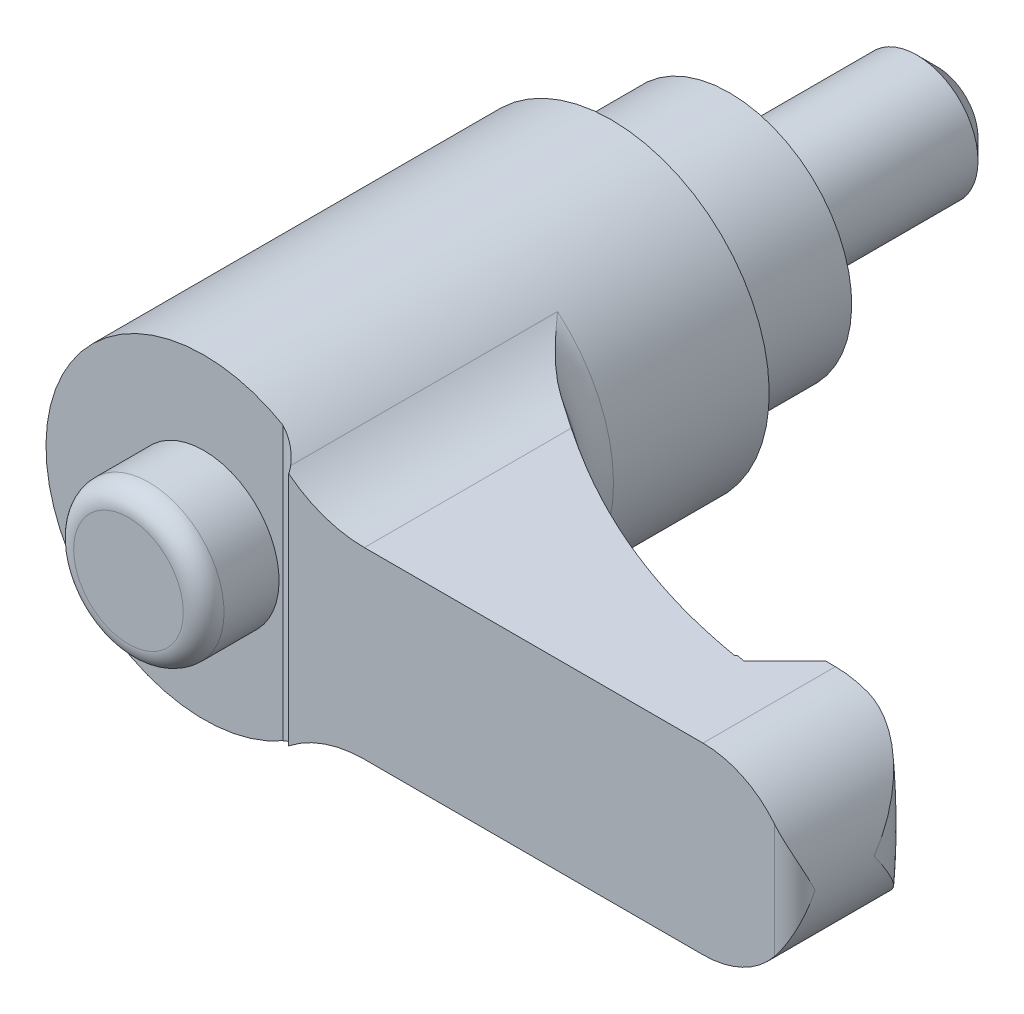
ISO-10303-21;
HEADER;
FILE_DESCRIPTION(('STEP AP214'),'2;1');
FILE_NAME('part.step','',(''),(''),'','','');
FILE_SCHEMA(('AUTOMOTIVE_DESIGN { 1 0 10303 214 1 1 1 1 }'));
ENDSEC;
DATA;
#1=APPLICATION_CONTEXT('core data for automotive mechanical design processes');
#2=APPLICATION_PROTOCOL_DEFINITION('international standard','automotive_design',2000,#1);
#3=PRODUCT_CONTEXT('',#1,'mechanical');
#4=PRODUCT('Part','Part','',(#3));
#5=PRODUCT_RELATED_PRODUCT_CATEGORY('part','',(#4));
#6=PRODUCT_DEFINITION_FORMATION('','',#4);
#7=PRODUCT_DEFINITION_CONTEXT('part definition',#1,'design');
#8=PRODUCT_DEFINITION('design','',#6,#7);
#9=PRODUCT_DEFINITION_SHAPE('','',#8);
#10=(LENGTH_UNIT() NAMED_UNIT(*) SI_UNIT(.MILLI.,.METRE.));
#11=(NAMED_UNIT(*) PLANE_ANGLE_UNIT() SI_UNIT($,.RADIAN.));
#12=(NAMED_UNIT(*) SI_UNIT($,.STERADIAN.) SOLID_ANGLE_UNIT());
#13=UNCERTAINTY_MEASURE_WITH_UNIT(LENGTH_MEASURE(1.E-05),#10,'distance_accuracy_value','');
#14=(GEOMETRIC_REPRESENTATION_CONTEXT(3) GLOBAL_UNCERTAINTY_ASSIGNED_CONTEXT((#13)) GLOBAL_UNIT_ASSIGNED_CONTEXT((#10,
#11,#12)) REPRESENTATION_CONTEXT('',''));
#15=CARTESIAN_POINT('',(0.,0.,0.));
#16=DIRECTION('',(0.,0.,1.));
#17=DIRECTION('',(1.,0.,0.));
#18=AXIS2_PLACEMENT_3D('',#15,#16,#17);
#19=CARTESIAN_POINT('',(4.8,0.,0.));
#20=DIRECTION('',(0.,0.,1.));
#21=DIRECTION('',(0.,-1.,0.));
#22=AXIS2_PLACEMENT_3D('',#19,#20,#21);
#23=PLANE('',#22);
#24=CARTESIAN_POINT('',(0.,0.,0.));
#25=DIRECTION('',(0.,0.,-1.));
#26=DIRECTION('',(0.,1.,0.));
#27=AXIS2_PLACEMENT_3D('',#24,#25,#26);
#28=CIRCLE('',#27,3.);
#29=CARTESIAN_POINT('',(0.,3.,0.));
#30=VERTEX_POINT('',#29);
#31=EDGE_CURVE('E493',#30,#30,#28,.T.);
#32=ORIENTED_EDGE('',*,*,#31,.F.);
#33=EDGE_LOOP('',(#32));
#34=FACE_BOUND('',#33,.T.);
#35=CARTESIAN_POINT('',(0.,0.,0.));
#36=DIRECTION('',(0.,0.,-1.));
#37=DIRECTION('',(0.,1.,0.));
#38=AXIS2_PLACEMENT_3D('',#35,#36,#37);
#39=CIRCLE('',#38,4.8);
#40=CARTESIAN_POINT('',(0.,4.8,0.));
#41=VERTEX_POINT('',#40);
#42=EDGE_CURVE('E433',#41,#41,#39,.T.);
#43=ORIENTED_EDGE('',*,*,#42,.T.);
#44=EDGE_LOOP('',(#43));
#45=FACE_BOUND('',#44,.T.);
#46=ADVANCED_FACE('F14',(#34,#45),#23,.F.);
#47=CARTESIAN_POINT('',(0.,0.,26.));
#48=DIRECTION('',(0.,0.,-1.));
#49=DIRECTION('',(0.,1.,0.));
#50=AXIS2_PLACEMENT_3D('',#47,#48,#49);
#51=PLANE('',#50);
#52=CARTESIAN_POINT('',(0.,0.,26.));
#53=DIRECTION('',(0.,0.,-1.));
#54=DIRECTION('',(0.,1.,0.));
#55=AXIS2_PLACEMENT_3D('',#52,#53,#54);
#56=CIRCLE('',#55,7.75);
#57=CARTESIAN_POINT('',(3.875,-6.7116968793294,26.));
#58=VERTEX_POINT('',#57);
#59=CARTESIAN_POINT('',(3.875,6.7116968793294,26.));
#60=VERTEX_POINT('',#59);
#61=EDGE_CURVE('E380',#58,#60,#56,.T.);
#62=ORIENTED_EDGE('',*,*,#61,.F.);
#63=DIRECTION('',(0.,1.,0.));
#64=VECTOR('',#63,1.);
#65=CARTESIAN_POINT('',(3.875,-9.,26.));
#66=LINE('',#65,#64);
#67=EDGE_CURVE('E467',#58,#60,#66,.T.);
#68=ORIENTED_EDGE('',*,*,#67,.T.);
#69=EDGE_LOOP('',(#62,#68));
#70=FACE_BOUND('',#69,.T.);
#71=CARTESIAN_POINT('',(0.,0.,26.));
#72=DIRECTION('',(0.,0.,-1.));
#73=DIRECTION('',(0.,1.,0.));
#74=AXIS2_PLACEMENT_3D('',#71,#72,#73);
#75=CIRCLE('',#74,3.69047619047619);
#76=CARTESIAN_POINT('',(0.,3.69047619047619,26.));
#77=VERTEX_POINT('',#76);
#78=EDGE_CURVE('E188',#77,#77,#75,.F.);
#79=ORIENTED_EDGE('',*,*,#78,.F.);
#80=EDGE_LOOP('',(#79));
#81=FACE_BOUND('',#80,.T.);
#82=ADVANCED_FACE('F163',(#70,#81),#51,.F.);
#83=CARTESIAN_POINT('',(25.5,0.,0.));
#84=DIRECTION('',(0.,0.,1.));
#85=DIRECTION('',(0.,-1.,0.));
#86=AXIS2_PLACEMENT_3D('',#83,#84,#85);
#87=CYLINDRICAL_SURFACE('',#86,4.5);
#88=CARTESIAN_POINT('',(30.,0.,23.1));
#89=CARTESIAN_POINT('',(30.0000000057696,-0.00397224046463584,23.0972162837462));
#90=CARTESIAN_POINT('',(29.9999947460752,-0.00794462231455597,23.0944324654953));
#91=CARTESIAN_POINT('',(29.9991779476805,-0.316207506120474,22.8784039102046));
#92=CARTESIAN_POINT('',(29.967472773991,-0.621260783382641,22.6646232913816));
#93=CARTESIAN_POINT('',(29.8729566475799,-1.07288244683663,22.3499400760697));
#94=CARTESIAN_POINT('',(29.8335087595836,-1.2227001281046,22.2458576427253));
#95=CARTESIAN_POINT('',(29.7386099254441,-1.51933949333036,22.0407893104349));
#96=CARTESIAN_POINT('',(29.6831664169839,-1.6661625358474,21.9398019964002));
#97=CARTESIAN_POINT('',(29.5225221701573,-2.0316181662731,21.690355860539));
#98=CARTESIAN_POINT('',(29.4064726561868,-2.24755940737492,21.5447545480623));
#99=CARTESIAN_POINT('',(29.1349908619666,-2.66429651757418,21.2699985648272));
#100=CARTESIAN_POINT('',(28.9796468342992,-2.86512503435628,21.1408080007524));
#101=CARTESIAN_POINT('',(28.6740094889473,-3.19567948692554,20.9378778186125));
#102=CARTESIAN_POINT('',(28.5328529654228,-3.3303385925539,20.8584463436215));
#103=CARTESIAN_POINT('',(28.2285136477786,-3.58389708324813,20.7186599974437));
#104=CARTESIAN_POINT('',(28.0653563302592,-3.70281438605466,20.6582833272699));
#105=CARTESIAN_POINT('',(27.7569268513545,-3.89637158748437,20.5739705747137));
#106=CARTESIAN_POINT('',(27.6155988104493,-3.97499958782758,20.5449430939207));
#107=CARTESIAN_POINT('',(27.3962983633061,-4.08175109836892,20.516319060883));
#108=CARTESIAN_POINT('',(27.3219652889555,-4.11547521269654,20.5092639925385));
#109=CARTESIAN_POINT('',(27.1713145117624,-4.17892025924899,20.5006475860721));
#110=CARTESIAN_POINT('',(27.0949977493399,-4.20864304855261,20.4990836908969));
#111=CARTESIAN_POINT('',(26.940135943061,-4.26413478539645,20.5019689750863));
#112=CARTESIAN_POINT('',(26.8615759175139,-4.28985895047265,20.5064814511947));
#113=CARTESIAN_POINT('',(26.7037978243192,-4.33677756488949,20.5220962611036));
#114=CARTESIAN_POINT('',(26.624580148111,-4.35797453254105,20.5331949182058));
#115=CARTESIAN_POINT('',(26.4663684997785,-4.39576374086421,20.5623470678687));
#116=CARTESIAN_POINT('',(26.3873744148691,-4.41235899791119,20.5803959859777));
#117=CARTESIAN_POINT('',(26.230581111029,-4.44101436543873,20.6236628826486));
#118=CARTESIAN_POINT('',(26.1527814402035,-4.4530762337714,20.6488780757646));
#119=CARTESIAN_POINT('',(25.9747863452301,-4.47604389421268,20.7158088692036));
#120=CARTESIAN_POINT('',(25.8753706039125,-4.48535121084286,20.7602222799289));
#121=CARTESIAN_POINT('',(25.7308199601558,-4.4943380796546,20.836059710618));
#122=CARTESIAN_POINT('',(25.6833620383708,-4.49650441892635,20.8629005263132));
#123=CARTESIAN_POINT('',(25.5902043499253,-4.4993369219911,20.9195771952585));
#124=CARTESIAN_POINT('',(25.5445050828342,-4.50000266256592,20.9494138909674));
#125=CARTESIAN_POINT('',(25.4998,-4.49999999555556,20.980704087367));
#126=B_SPLINE_CURVE_WITH_KNOTS('',3,(#88,#89,#90,#91,#92,#93,#94,#95,#96,#97,#98,#99,#100,#101,
#102,#103,#104,#105,#106,#107,#108,#109,#110,#111,#112,#113,#114,#115,#116,#117,#118,#119,#120,
#121,#122,#123,#124,#125),.UNSPECIFIED.,.F.,.F.,(4,2,2,2,2,2,2,2,2,2,2,2,2,2,2,2,2,2,4),(0.,
0.0145521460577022,1.12923174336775,1.68863416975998,2.24777690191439,3.0999476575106,
3.95022123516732,4.58000022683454,5.20905610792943,5.69992949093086,5.94545977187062,
6.19087570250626,6.43886797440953,6.68672193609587,6.93441304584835,7.18200801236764,
7.50864895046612,7.67223429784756,7.83586577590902),.UNSPECIFIED.);
#127=CARTESIAN_POINT('',(27.0737254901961,-4.21584962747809,20.5));
#128=VERTEX_POINT('',#127);
#129=CARTESIAN_POINT('',(30.,0.,23.1));
#130=VERTEX_POINT('',#129);
#131=EDGE_CURVE('E133',#128,#130,#126,.F.);
#132=ORIENTED_EDGE('',*,*,#131,.T.);
#133=CARTESIAN_POINT('',(30.,0.,23.1));
#134=CARTESIAN_POINT('',(30.0000000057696,0.00397224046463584,23.0972162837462));
#135=CARTESIAN_POINT('',(29.9999947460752,0.00794462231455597,23.0944324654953));
#136=CARTESIAN_POINT('',(29.9991779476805,0.316207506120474,22.8784039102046));
#137=CARTESIAN_POINT('',(29.967472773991,0.621260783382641,22.6646232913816));
#138=CARTESIAN_POINT('',(29.8729566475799,1.07288244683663,22.3499400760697));
#139=CARTESIAN_POINT('',(29.8335087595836,1.2227001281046,22.2458576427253));
#140=CARTESIAN_POINT('',(29.7386099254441,1.51933949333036,22.0407893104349));
#141=CARTESIAN_POINT('',(29.6831664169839,1.6661625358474,21.9398019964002));
#142=CARTESIAN_POINT('',(29.5225221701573,2.0316181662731,21.690355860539));
#143=CARTESIAN_POINT('',(29.4064726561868,2.24755940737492,21.5447545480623));
#144=CARTESIAN_POINT('',(29.1349908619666,2.66429651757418,21.2699985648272));
#145=CARTESIAN_POINT('',(28.9796468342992,2.86512503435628,21.1408080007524));
#146=CARTESIAN_POINT('',(28.6740094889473,3.19567948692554,20.9378778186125));
#147=CARTESIAN_POINT('',(28.5328529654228,3.3303385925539,20.8584463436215));
#148=CARTESIAN_POINT('',(28.2285136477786,3.58389708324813,20.7186599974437));
#149=CARTESIAN_POINT('',(28.0653563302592,3.70281438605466,20.6582833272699));
#150=CARTESIAN_POINT('',(27.7569268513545,3.89637158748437,20.5739705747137));
#151=CARTESIAN_POINT('',(27.6155988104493,3.97499958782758,20.5449430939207));
#152=CARTESIAN_POINT('',(27.3962983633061,4.08175109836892,20.516319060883));
#153=CARTESIAN_POINT('',(27.3219652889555,4.11547521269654,20.5092639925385));
#154=CARTESIAN_POINT('',(27.1713145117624,4.17892025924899,20.5006475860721));
#155=CARTESIAN_POINT('',(27.0949977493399,4.20864304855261,20.4990836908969));
#156=CARTESIAN_POINT('',(26.940135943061,4.26413478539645,20.5019689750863));
#157=CARTESIAN_POINT('',(26.8615759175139,4.28985895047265,20.5064814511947));
#158=CARTESIAN_POINT('',(26.7037978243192,4.33677756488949,20.5220962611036));
#159=CARTESIAN_POINT('',(26.624580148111,4.35797453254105,20.5331949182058));
#160=CARTESIAN_POINT('',(26.4663684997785,4.39576374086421,20.5623470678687));
#161=CARTESIAN_POINT('',(26.3873744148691,4.41235899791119,20.5803959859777));
#162=CARTESIAN_POINT('',(26.230581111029,4.44101436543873,20.6236628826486));
#163=CARTESIAN_POINT('',(26.1527814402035,4.4530762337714,20.6488780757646));
#164=CARTESIAN_POINT('',(25.9747863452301,4.47604389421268,20.7158088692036));
#165=CARTESIAN_POINT('',(25.8753706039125,4.48535121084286,20.7602222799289));
#166=CARTESIAN_POINT('',(25.7308199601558,4.4943380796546,20.836059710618));
#167=CARTESIAN_POINT('',(25.6833620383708,4.49650441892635,20.8629005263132));
#168=CARTESIAN_POINT('',(25.5902043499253,4.4993369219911,20.9195771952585));
#169=CARTESIAN_POINT('',(25.5445050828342,4.50000266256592,20.9494138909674));
#170=CARTESIAN_POINT('',(25.4998,4.49999999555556,20.980704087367));
#171=B_SPLINE_CURVE_WITH_KNOTS('',3,(#133,#134,#135,#136,#137,#138,#139,#140,#141,#142,#143,
#144,#145,#146,#147,#148,#149,#150,#151,#152,#153,#154,#155,#156,#157,#158,#159,#160,#161,#162,
#163,#164,#165,#166,#167,#168,#169,#170),.UNSPECIFIED.,.F.,.F.,(4,2,2,2,2,2,2,2,2,2,2,2,2,2,2,2,
2,2,4),(0.,0.0145521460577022,1.12923174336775,1.68863416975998,2.24777690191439,
3.0999476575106,3.95022123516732,4.58000022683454,5.20905610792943,5.69992949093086,
5.94545977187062,6.19087570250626,6.43886797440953,6.68672193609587,6.93441304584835,
7.18200801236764,7.50864895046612,7.67223429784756,7.83586577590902),.UNSPECIFIED.);
#172=CARTESIAN_POINT('',(27.0737254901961,4.21584962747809,20.5));
#173=VERTEX_POINT('',#172);
#174=EDGE_CURVE('E130',#130,#173,#171,.T.);
#175=ORIENTED_EDGE('',*,*,#174,.T.);
#176=CARTESIAN_POINT('',(25.5,0.,20.5));
#177=DIRECTION('',(0.,0.,-1.));
#178=DIRECTION('',(0.,1.,0.));
#179=AXIS2_PLACEMENT_3D('',#176,#177,#178);
#180=CIRCLE('',#179,4.5);
#181=CARTESIAN_POINT('',(25.5,4.5,20.5));
#182=VERTEX_POINT('',#181);
#183=EDGE_CURVE('E405',#173,#182,#180,.F.);
#184=ORIENTED_EDGE('',*,*,#183,.T.);
#185=DIRECTION('',(0.,0.,1.));
#186=VECTOR('',#185,1.);
#187=CARTESIAN_POINT('',(25.5,4.5,0.));
#188=LINE('',#187,#186);
#189=CARTESIAN_POINT('',(25.5,4.5,27.));
#190=VERTEX_POINT('',#189);
#191=EDGE_CURVE('E404',#182,#190,#188,.T.);
#192=ORIENTED_EDGE('',*,*,#191,.T.);
#193=CARTESIAN_POINT('',(25.5,0.,27.));
#194=DIRECTION('',(0.,0.,1.));
#195=DIRECTION('',(0.,-1.,0.));
#196=AXIS2_PLACEMENT_3D('',#193,#194,#195);
#197=CIRCLE('',#196,4.5);
#198=CARTESIAN_POINT('',(29.,2.82842712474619,27.));
#199=VERTEX_POINT('',#198);
#200=EDGE_CURVE('E383',#199,#190,#197,.T.);
#201=ORIENTED_EDGE('',*,*,#200,.F.);
#202=CARTESIAN_POINT('',(29.,2.82842712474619,27.));
#203=CARTESIAN_POINT('',(29.0452569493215,2.77244060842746,26.9999705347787));
#204=CARTESIAN_POINT('',(29.08910814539,2.71541373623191,26.9969310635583));
#205=CARTESIAN_POINT('',(29.1737346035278,2.59976408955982,26.9857221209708));
#206=CARTESIAN_POINT('',(29.2145155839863,2.54114457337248,26.9775624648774));
#207=CARTESIAN_POINT('',(29.2926216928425,2.42301598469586,26.9570723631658));
#208=CARTESIAN_POINT('',(29.3299701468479,2.36351669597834,26.9447732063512));
#209=CARTESIAN_POINT('',(29.4015263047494,2.24343051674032,26.9166544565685));
#210=CARTESIAN_POINT('',(29.4357319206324,2.18284293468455,26.9008325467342));
#211=CARTESIAN_POINT('',(29.5205149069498,2.0242761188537,26.8558925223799));
#212=CARTESIAN_POINT('',(29.5686353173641,1.92562477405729,26.8244847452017));
#213=CARTESIAN_POINT('',(29.6569408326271,1.7267576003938,26.7560098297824));
#214=CARTESIAN_POINT('',(29.6971228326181,1.62654117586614,26.7189404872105));
#215=CARTESIAN_POINT('',(29.769924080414,1.42454335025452,26.6403878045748));
#216=CARTESIAN_POINT('',(29.8025090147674,1.32275698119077,26.5988856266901));
#217=CARTESIAN_POINT('',(29.8600923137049,1.1184186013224,26.5127603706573));
#218=CARTESIAN_POINT('',(29.8850925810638,1.0158667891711,26.4681380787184));
#219=CARTESIAN_POINT('',(29.9373931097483,0.763467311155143,26.3559210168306));
#220=CARTESIAN_POINT('',(29.9605764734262,0.613303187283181,26.2871011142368));
#221=CARTESIAN_POINT('',(29.9916507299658,0.312779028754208,26.1474204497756));
#222=CARTESIAN_POINT('',(29.999578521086,0.162420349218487,26.0765650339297));
#223=CARTESIAN_POINT('',(29.9999945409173,0.00809034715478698,26.0038138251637));
#224=CARTESIAN_POINT('',(29.999999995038,0.00404514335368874,26.0019068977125));
#225=CARTESIAN_POINT('',(30.,0.,26.));
#226=B_SPLINE_CURVE_WITH_KNOTS('',3,(#202,#203,#204,#205,#206,#207,#208,#209,#210,#211,#212,
#213,#214,#215,#216,#217,#218,#219,#220,#221,#222,#223,#224,#225),.UNSPECIFIED.,.F.,.F.,(4,2,2,
2,2,2,2,2,2,2,2,4),(0.,0.215782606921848,0.431152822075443,0.644930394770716,0.858848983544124,
1.20082332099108,1.5429311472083,1.88655545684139,2.23009348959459,2.7297347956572,
3.22816610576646,3.2415825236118),.UNSPECIFIED.);
#227=CARTESIAN_POINT('',(30.,0.,26.));
#228=VERTEX_POINT('',#227);
#229=EDGE_CURVE('E174',#228,#199,#226,.F.);
#230=ORIENTED_EDGE('',*,*,#229,.F.);
#231=CARTESIAN_POINT('',(29.,-2.82842712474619,27.));
#232=CARTESIAN_POINT('',(29.0452569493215,-2.77244060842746,26.9999705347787));
#233=CARTESIAN_POINT('',(29.08910814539,-2.71541373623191,26.9969310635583));
#234=CARTESIAN_POINT('',(29.1737346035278,-2.59976408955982,26.9857221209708));
#235=CARTESIAN_POINT('',(29.2145155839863,-2.54114457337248,26.9775624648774));
#236=CARTESIAN_POINT('',(29.2926216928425,-2.42301598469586,26.9570723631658));
#237=CARTESIAN_POINT('',(29.3299701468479,-2.36351669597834,26.9447732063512));
#238=CARTESIAN_POINT('',(29.4015263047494,-2.24343051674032,26.9166544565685));
#239=CARTESIAN_POINT('',(29.4357319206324,-2.18284293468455,26.9008325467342));
#240=CARTESIAN_POINT('',(29.5205149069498,-2.0242761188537,26.8558925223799));
#241=CARTESIAN_POINT('',(29.5686353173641,-1.92562477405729,26.8244847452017));
#242=CARTESIAN_POINT('',(29.6569408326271,-1.7267576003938,26.7560098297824));
#243=CARTESIAN_POINT('',(29.6971228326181,-1.62654117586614,26.7189404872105));
#244=CARTESIAN_POINT('',(29.769924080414,-1.42454335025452,26.6403878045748));
#245=CARTESIAN_POINT('',(29.8025090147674,-1.32275698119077,26.5988856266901));
#246=CARTESIAN_POINT('',(29.8600923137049,-1.1184186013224,26.5127603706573));
#247=CARTESIAN_POINT('',(29.8850925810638,-1.0158667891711,26.4681380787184));
#248=CARTESIAN_POINT('',(29.9373931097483,-0.763467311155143,26.3559210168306));
#249=CARTESIAN_POINT('',(29.9605764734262,-0.613303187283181,26.2871011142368));
#250=CARTESIAN_POINT('',(29.9916507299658,-0.312779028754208,26.1474204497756));
#251=CARTESIAN_POINT('',(29.999578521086,-0.162420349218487,26.0765650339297));
#252=CARTESIAN_POINT('',(29.9999945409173,-0.00809034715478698,26.0038138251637));
#253=CARTESIAN_POINT('',(29.999999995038,-0.00404514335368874,26.0019068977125));
#254=CARTESIAN_POINT('',(30.,0.,26.));
#255=B_SPLINE_CURVE_WITH_KNOTS('',3,(#231,#232,#233,#234,#235,#236,#237,#238,#239,#240,#241,
#242,#243,#244,#245,#246,#247,#248,#249,#250,#251,#252,#253,#254),.UNSPECIFIED.,.F.,.F.,(4,2,2,
2,2,2,2,2,2,2,2,4),(0.,0.215782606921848,0.431152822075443,0.644930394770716,0.858848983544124,
1.20082332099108,1.5429311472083,1.88655545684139,2.23009348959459,2.7297347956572,
3.22816610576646,3.2415825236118),.UNSPECIFIED.);
#256=CARTESIAN_POINT('',(29.,-2.82842712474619,27.));
#257=VERTEX_POINT('',#256);
#258=EDGE_CURVE('E182',#257,#228,#255,.T.);
#259=ORIENTED_EDGE('',*,*,#258,.F.);
#260=CARTESIAN_POINT('',(25.5,-4.5,27.));
#261=VERTEX_POINT('',#260);
#262=EDGE_CURVE('E389',#261,#257,#197,.T.);
#263=ORIENTED_EDGE('',*,*,#262,.F.);
#264=DIRECTION('',(0.,0.,1.));
#265=VECTOR('',#264,1.);
#266=CARTESIAN_POINT('',(25.5,-4.5,0.));
#267=LINE('',#266,#265);
#268=CARTESIAN_POINT('',(25.5,-4.5,20.5));
#269=VERTEX_POINT('',#268);
#270=EDGE_CURVE('E409',#269,#261,#267,.T.);
#271=ORIENTED_EDGE('',*,*,#270,.F.);
#272=EDGE_CURVE('E140',#269,#128,#180,.F.);
#273=ORIENTED_EDGE('',*,*,#272,.T.);
#274=EDGE_LOOP('',(#132,#175,#184,#192,#201,#230,#259,#263,#271,#273));
#275=FACE_BOUND('',#274,.T.);
#276=ADVANCED_FACE('F138',(#275),#87,.T.);
#277=CARTESIAN_POINT('',(28.072410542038,-9.,-7.06806810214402));
#278=DIRECTION('',(0.,1.,0.));
#279=DIRECTION('',(-1.,0.,0.));
#280=AXIS2_PLACEMENT_3D('',#277,#278,#279);
#281=CYLINDRICAL_SURFACE('',#280,30.);
#282=CARTESIAN_POINT('',(22.457864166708,5.40076351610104,22.4018635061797));
#283=CARTESIAN_POINT('',(22.5328704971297,5.02783315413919,22.4161416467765));
#284=CARTESIAN_POINT('',(22.6003478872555,4.65331694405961,22.4287120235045));
#285=CARTESIAN_POINT('',(22.7199001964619,3.90172149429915,22.4506465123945));
#286=CARTESIAN_POINT('',(22.7719742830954,3.52464211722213,22.4600104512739));
#287=CARTESIAN_POINT('',(22.860391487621,2.76836181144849,22.4757441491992));
#288=CARTESIAN_POINT('',(22.8967259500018,2.38915983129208,22.4821122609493));
#289=CARTESIAN_POINT('',(22.953399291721,1.62955869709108,22.4919810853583));
#290=CARTESIAN_POINT('',(22.9737386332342,1.24915957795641,22.4954818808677));
#291=CARTESIAN_POINT('',(23.0101209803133,0.119914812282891,22.5017516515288));
#292=CARTESIAN_POINT('',(23.0030278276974,-0.62982701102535,22.5005458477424));
#293=CARTESIAN_POINT('',(22.9265280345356,-2.12549757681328,22.487326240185));
#294=CARTESIAN_POINT('',(22.8571649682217,-2.87142861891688,22.4753199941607));
#295=CARTESIAN_POINT('',(22.717445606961,-3.91200869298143,22.450161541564));
#296=CARTESIAN_POINT('',(22.6723784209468,-4.21035002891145,22.4419679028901));
#297=CARTESIAN_POINT('',(22.5724363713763,-4.80637536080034,22.4235048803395));
#298=CARTESIAN_POINT('',(22.5175283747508,-5.10405358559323,22.4132284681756));
#299=CARTESIAN_POINT('',(22.457864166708,-5.40076351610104,22.4018635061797));
#300=B_SPLINE_CURVE_WITH_KNOTS('',3,(#282,#283,#284,#285,#286,#287,#288,#289,#290,#291,#292,
#293,#294,#295,#296,#297,#298,#299),.UNSPECIFIED.,.F.,.F.,(4,2,2,2,2,2,2,2,4),(0.,
1.14192528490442,2.28391227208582,3.4265264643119,4.56910763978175,6.81558260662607,
9.06048679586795,9.96586555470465,10.8743519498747),.UNSPECIFIED.);
#301=CARTESIAN_POINT('',(23.,0.,22.5));
#302=VERTEX_POINT('',#301);
#303=CARTESIAN_POINT('',(22.6238084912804,-4.5,22.4329951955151));
#304=VERTEX_POINT('',#303);
#305=EDGE_CURVE('E136',#302,#304,#300,.T.);
#306=ORIENTED_EDGE('',*,*,#305,.F.);
#307=DIRECTION('',(0.,1.,0.));
#308=VECTOR('',#307,1.);
#309=CARTESIAN_POINT('',(23.,-9.,22.5));
#310=LINE('',#309,#308);
#311=CARTESIAN_POINT('',(23.,-4.5,22.5));
#312=VERTEX_POINT('',#311);
#313=EDGE_CURVE('E473',#312,#302,#310,.T.);
#314=ORIENTED_EDGE('',*,*,#313,.F.);
#315=CARTESIAN_POINT('',(28.072410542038,-4.5,-7.06806810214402));
#316=DIRECTION('',(0.,1.,0.));
#317=DIRECTION('',(-1.,0.,0.));
#318=AXIS2_PLACEMENT_3D('',#315,#316,#317);
#319=CIRCLE('',#318,30.);
#320=EDGE_CURVE('E464',#312,#304,#319,.F.);
#321=ORIENTED_EDGE('',*,*,#320,.T.);
#322=EDGE_LOOP('',(#306,#314,#321));
#323=FACE_BOUND('',#322,.T.);
#324=ADVANCED_FACE('F162',(#323),#281,.F.);
#325=CARTESIAN_POINT('',(27.4,-9.,20.5));
#326=DIRECTION('',(0.,0.,-1.));
#327=DIRECTION('',(0.,1.,0.));
#328=AXIS2_PLACEMENT_3D('',#325,#326,#327);
#329=PLANE('',#328);
#330=ORIENTED_EDGE('',*,*,#183,.F.);
#331=CARTESIAN_POINT('',(0.,0.,20.5));
#332=DIRECTION('',(0.,0.,-1.));
#333=DIRECTION('',(0.,1.,0.));
#334=AXIS2_PLACEMENT_3D('',#331,#332,#333);
#335=CIRCLE('',#334,27.4);
#336=EDGE_CURVE('E37',#173,#128,#335,.T.);
#337=ORIENTED_EDGE('',*,*,#336,.T.);
#338=ORIENTED_EDGE('',*,*,#272,.F.);
#339=DIRECTION('',(-1.,0.,0.));
#340=VECTOR('',#339,1.);
#341=CARTESIAN_POINT('',(25.5,-4.5,20.5));
#342=LINE('',#341,#340);
#343=CARTESIAN_POINT('',(25.,-4.5,20.5));
#344=VERTEX_POINT('',#343);
#345=EDGE_CURVE('E540',#269,#344,#342,.T.);
#346=ORIENTED_EDGE('',*,*,#345,.T.);
#347=DIRECTION('',(0.,1.,0.));
#348=VECTOR('',#347,1.);
#349=CARTESIAN_POINT('',(25.,-9.,20.5));
#350=LINE('',#349,#348);
#351=CARTESIAN_POINT('',(25.,4.5,20.5));
#352=VERTEX_POINT('',#351);
#353=EDGE_CURVE('E460',#344,#352,#350,.T.);
#354=ORIENTED_EDGE('',*,*,#353,.T.);
#355=DIRECTION('',(1.,0.,0.));
#356=VECTOR('',#355,1.);
#357=CARTESIAN_POINT('',(8.87764045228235,4.5,20.5));
#358=LINE('',#357,#356);
#359=EDGE_CURVE('E419',#352,#182,#358,.T.);
#360=ORIENTED_EDGE('',*,*,#359,.T.);
#361=EDGE_LOOP('',(#330,#337,#338,#346,#354,#360));
#362=FACE_BOUND('',#361,.T.);
#363=ADVANCED_FACE('F196',(#362),#329,.T.);
#364=CARTESIAN_POINT('',(0.,0.,27.));
#365=DIRECTION('',(0.,0.,1.));
#366=DIRECTION('',(0.,-1.,0.));
#367=AXIS2_PLACEMENT_3D('',#364,#365,#366);
#368=PLANE('',#367);
#369=CARTESIAN_POINT('',(8.87764045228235,10.5,27.));
#370=DIRECTION('',(0.,0.,1.));
#371=DIRECTION('',(1.,0.,0.));
#372=AXIS2_PLACEMENT_3D('',#369,#370,#371);
#373=CIRCLE('',#372,6.);
#374=CARTESIAN_POINT('',(5.16666666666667,5.78527057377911,27.));
#375=VERTEX_POINT('',#374);
#376=CARTESIAN_POINT('',(8.87764045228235,4.5,27.));
#377=VERTEX_POINT('',#376);
#378=EDGE_CURVE('E414',#375,#377,#373,.T.);
#379=ORIENTED_EDGE('',*,*,#378,.F.);
#380=DIRECTION('',(0.,1.,0.));
#381=VECTOR('',#380,1.);
#382=CARTESIAN_POINT('',(5.16666666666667,-9.,27.));
#383=LINE('',#382,#381);
#384=CARTESIAN_POINT('',(5.16666666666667,-5.78527057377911,27.));
#385=VERTEX_POINT('',#384);
#386=EDGE_CURVE('E453',#385,#375,#383,.T.);
#387=ORIENTED_EDGE('',*,*,#386,.F.);
#388=CARTESIAN_POINT('',(8.87764045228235,-10.5,27.));
#389=DIRECTION('',(0.,0.,1.));
#390=DIRECTION('',(1.,0.,0.));
#391=AXIS2_PLACEMENT_3D('',#388,#389,#390);
#392=CIRCLE('',#391,6.);
#393=CARTESIAN_POINT('',(8.87764045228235,-4.5,27.));
#394=VERTEX_POINT('',#393);
#395=EDGE_CURVE('E417',#394,#385,#392,.T.);
#396=ORIENTED_EDGE('',*,*,#395,.F.);
#397=DIRECTION('',(-1.,0.,0.));
#398=VECTOR('',#397,1.);
#399=CARTESIAN_POINT('',(25.5,-4.5,27.));
#400=LINE('',#399,#398);
#401=EDGE_CURVE('E413',#261,#394,#400,.T.);
#402=ORIENTED_EDGE('',*,*,#401,.F.);
#403=ORIENTED_EDGE('',*,*,#262,.T.);
#404=DIRECTION('',(0.,1.,0.));
#405=VECTOR('',#404,1.);
#406=CARTESIAN_POINT('',(29.,-9.,27.));
#407=LINE('',#406,#405);
#408=EDGE_CURVE('E401',#257,#199,#407,.T.);
#409=ORIENTED_EDGE('',*,*,#408,.T.);
#410=ORIENTED_EDGE('',*,*,#200,.T.);
#411=DIRECTION('',(1.,0.,0.));
#412=VECTOR('',#411,1.);
#413=CARTESIAN_POINT('',(8.87764045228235,4.5,27.));
#414=LINE('',#413,#412);
#415=EDGE_CURVE('E400',#377,#190,#414,.T.);
#416=ORIENTED_EDGE('',*,*,#415,.F.);
#417=EDGE_LOOP('',(#379,#387,#396,#402,#403,#409,#410,#416));
#418=FACE_BOUND('',#417,.T.);
#419=ADVANCED_FACE('F244',(#418),#368,.T.);
#420=CARTESIAN_POINT('',(0.,0.,0.));
#421=DIRECTION('',(0.,0.,-1.));
#422=DIRECTION('',(0.,1.,0.));
#423=AXIS2_PLACEMENT_3D('',#420,#421,#422);
#424=CYLINDRICAL_SURFACE('',#423,7.75);
#425=CARTESIAN_POINT('',(0.,0.,13.6426560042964));
#426=DIRECTION('',(0.,0.,-1.));
#427=DIRECTION('',(0.,1.,0.));
#428=AXIS2_PLACEMENT_3D('',#425,#426,#427);
#429=CIRCLE('',#428,7.75);
#430=CARTESIAN_POINT('',(5.00376098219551,5.91818181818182,13.6426560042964));
#431=VERTEX_POINT('',#430);
#432=CARTESIAN_POINT('',(5.00376098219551,-5.91818181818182,13.6426560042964));
#433=VERTEX_POINT('',#432);
#434=EDGE_CURVE('E374',#431,#433,#429,.T.);
#435=ORIENTED_EDGE('',*,*,#434,.T.);
#436=DIRECTION('',(0.,0.,1.));
#437=VECTOR('',#436,1.);
#438=CARTESIAN_POINT('',(5.00376098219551,-5.91818181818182,0.));
#439=LINE('',#438,#437);
#440=CARTESIAN_POINT('',(5.00376098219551,-5.91818181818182,26.7442638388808));
#441=VERTEX_POINT('',#440);
#442=EDGE_CURVE('E425',#433,#441,#439,.T.);
#443=ORIENTED_EDGE('',*,*,#442,.T.);
#444=CARTESIAN_POINT('',(3.875,-6.7116968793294,26.));
#445=CARTESIAN_POINT('',(3.9487248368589,-6.66914880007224,26.0179048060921));
#446=CARTESIAN_POINT('',(4.02097408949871,-6.62579988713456,26.039874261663));
#447=CARTESIAN_POINT('',(4.16199829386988,-6.53812669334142,26.0915573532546));
#448=CARTESIAN_POINT('',(4.23077434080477,-6.49380272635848,26.1212685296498));
#449=CARTESIAN_POINT('',(4.36202505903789,-6.40634475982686,26.1868862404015));
#450=CARTESIAN_POINT('',(4.42463632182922,-6.36322379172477,26.2225378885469));
#451=CARTESIAN_POINT('',(4.54579687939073,-6.27724013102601,26.3004737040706));
#452=CARTESIAN_POINT('',(4.60434578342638,-6.23437746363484,26.3427585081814));
#453=CARTESIAN_POINT('',(4.71026264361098,-6.1546555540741,26.4283893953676));
#454=CARTESIAN_POINT('',(4.75813291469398,-6.11768751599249,26.4710140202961));
#455=CARTESIAN_POINT('',(4.8500303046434,-6.04509175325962,26.56120031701));
#456=CARTESIAN_POINT('',(4.89405965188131,-6.00946325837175,26.6087590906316));
#457=CARTESIAN_POINT('',(4.97925799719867,-5.9390764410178,26.7103994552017));
#458=CARTESIAN_POINT('',(5.02029084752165,-5.90438218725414,26.7646407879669));
#459=CARTESIAN_POINT('',(5.09738332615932,-5.83796295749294,26.8783962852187));
#460=CARTESIAN_POINT('',(5.13343386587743,-5.80624344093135,26.9379197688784));
#461=CARTESIAN_POINT('',(5.16666666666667,-5.77650894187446,27.));
#462=B_SPLINE_CURVE_WITH_KNOTS('',3,(#444,#445,#446,#447,#448,#449,#450,#451,#452,#453,#454,
#455,#456,#457,#458,#459,#460,#461),.UNSPECIFIED.,.F.,.F.,(4,2,2,2,2,2,2,2,4),(0.,
0.260811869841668,0.521540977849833,0.773092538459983,1.02466826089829,1.24638864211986,
1.4679795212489,1.69664297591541,1.92571819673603),.UNSPECIFIED.);
#463=EDGE_CURVE('E218',#58,#441,#462,.T.);
#464=ORIENTED_EDGE('',*,*,#463,.F.);
#465=ORIENTED_EDGE('',*,*,#61,.T.);
#466=CARTESIAN_POINT('',(5.16666666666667,5.77650894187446,27.));
#467=CARTESIAN_POINT('',(5.13714077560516,5.80292379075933,26.9448365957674));
#468=CARTESIAN_POINT('',(5.1053831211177,5.83091583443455,26.8916890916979));
#469=CARTESIAN_POINT('',(5.03785941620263,5.88934998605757,26.7895453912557));
#470=CARTESIAN_POINT('',(5.00209830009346,5.91978906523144,26.7405442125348));
#471=CARTESIAN_POINT('',(4.92700880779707,5.98243056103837,26.646752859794));
#472=CARTESIAN_POINT('',(4.88768622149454,6.01463008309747,26.6019560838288));
#473=CARTESIAN_POINT('',(4.80573825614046,6.08030777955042,26.5165060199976));
#474=CARTESIAN_POINT('',(4.76311181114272,6.11378636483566,26.4758540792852));
#475=CARTESIAN_POINT('',(4.63114473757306,6.21507952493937,26.3605779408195));
#476=CARTESIAN_POINT('',(4.53728284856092,6.28411879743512,26.2920994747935));
#477=CARTESIAN_POINT('',(4.3393749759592,6.42237347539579,26.1724069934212));
#478=CARTESIAN_POINT('',(4.23533663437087,6.49158871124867,26.1211801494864));
#479=CARTESIAN_POINT('',(4.08621326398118,6.5854168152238,26.0632790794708));
#480=CARTESIAN_POINT('',(4.04469277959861,6.61100425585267,26.0487072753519));
#481=CARTESIAN_POINT('',(3.96061680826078,6.66171281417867,26.0222973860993));
#482=CARTESIAN_POINT('',(3.91806319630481,6.68683464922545,26.0104547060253));
#483=CARTESIAN_POINT('',(3.8750000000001,6.7116968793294,26.));
#484=B_SPLINE_CURVE_WITH_KNOTS('',3,(#466,#467,#468,#469,#470,#471,#472,#473,#474,#475,#476,
#477,#478,#479,#480,#481,#482,#483),.UNSPECIFIED.,.F.,.F.,(4,2,2,2,2,2,2,2,4),(0.,
0.203583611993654,0.406919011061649,0.609929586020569,0.813005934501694,1.21684507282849,
1.62038324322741,1.77301957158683,1.9253970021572),.UNSPECIFIED.);
#485=CARTESIAN_POINT('',(5.0037609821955,5.91818181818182,26.7442638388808));
#486=VERTEX_POINT('',#485);
#487=EDGE_CURVE('E232',#486,#60,#484,.T.);
#488=ORIENTED_EDGE('',*,*,#487,.F.);
#489=DIRECTION('',(0.,0.,1.));
#490=VECTOR('',#489,1.);
#491=CARTESIAN_POINT('',(5.00376098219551,5.91818181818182,0.));
#492=LINE('',#491,#490);
#493=EDGE_CURVE('E431',#431,#486,#492,.T.);
#494=ORIENTED_EDGE('',*,*,#493,.F.);
#495=EDGE_LOOP('',(#435,#443,#464,#465,#488,#494));
#496=FACE_BOUND('',#495,.T.);
#497=CARTESIAN_POINT('',(0.,0.,6.));
#498=DIRECTION('',(0.,0.,-1.));
#499=DIRECTION('',(0.,1.,0.));
#500=AXIS2_PLACEMENT_3D('',#497,#498,#499);
#501=CIRCLE('',#500,7.75);
#502=CARTESIAN_POINT('',(0.,7.75,6.));
#503=VERTEX_POINT('',#502);
#504=EDGE_CURVE('E378',#503,#503,#501,.T.);
#505=ORIENTED_EDGE('',*,*,#504,.F.);
#506=EDGE_LOOP('',(#505));
#507=FACE_BOUND('',#506,.T.);
#508=ADVANCED_FACE('F242',(#496,#507),#424,.T.);
#509=CARTESIAN_POINT('',(8.87764045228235,10.5,0.));
#510=DIRECTION('',(0.,0.,1.));
#511=DIRECTION('',(0.,-1.,0.));
#512=AXIS2_PLACEMENT_3D('',#509,#510,#511);
#513=CYLINDRICAL_SURFACE('',#512,6.);
#514=DIRECTION('',(0.,0.,1.));
#515=VECTOR('',#514,1.);
#516=CARTESIAN_POINT('',(8.87764045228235,4.5,0.));
#517=LINE('',#516,#515);
#518=CARTESIAN_POINT('',(8.87764045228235,4.5,16.8419191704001));
#519=VERTEX_POINT('',#518);
#520=EDGE_CURVE('E408',#519,#377,#517,.T.);
#521=ORIENTED_EDGE('',*,*,#520,.F.);
#522=CARTESIAN_POINT('',(8.87784045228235,4.50000000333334,16.8420543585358));
#523=CARTESIAN_POINT('',(8.76298675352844,4.50000678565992,16.7644412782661));
#524=CARTESIAN_POINT('',(8.64795886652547,4.50329006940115,16.687069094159));
#525=CARTESIAN_POINT('',(8.41786670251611,4.51653249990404,16.5336144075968));
#526=CARTESIAN_POINT('',(8.30280331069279,4.52647413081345,16.457529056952));
#527=CARTESIAN_POINT('',(8.07233993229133,4.55315590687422,16.3070362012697));
#528=CARTESIAN_POINT('',(7.95693991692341,4.56989665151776,16.2326288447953));
#529=CARTESIAN_POINT('',(7.72548993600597,4.61048878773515,16.0861329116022));
#530=CARTESIAN_POINT('',(7.60943905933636,4.63435875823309,16.0140509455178));
#531=CARTESIAN_POINT('',(7.49320434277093,4.66190641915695,15.9436475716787));
#532=B_SPLINE_CURVE_WITH_KNOTS('',3,(#522,#523,#524,#525,#526,#527,#528,#529,#530,#531),
.UNSPECIFIED.,.F.,.F.,(4,2,2,2,4),(0.,0.415830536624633,0.830571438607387,1.24534891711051,
1.66121688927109),.UNSPECIFIED.);
#533=CARTESIAN_POINT('',(7.49353468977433,4.66182809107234,15.9438475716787));
#534=VERTEX_POINT('',#533);
#535=EDGE_CURVE('E258',#519,#534,#532,.T.);
#536=ORIENTED_EDGE('',*,*,#535,.T.);
#537=CARTESIAN_POINT('',(7.49386505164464,4.66174977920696,15.9440475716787));
#538=CARTESIAN_POINT('',(7.41534599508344,4.68036361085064,15.8965108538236));
#539=CARTESIAN_POINT('',(7.33813459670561,4.70033346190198,15.8474028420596));
#540=CARTESIAN_POINT('',(7.18628313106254,4.74278447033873,15.7464454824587));
#541=CARTESIAN_POINT('',(7.11164195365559,4.76526452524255,15.694597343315));
#542=CARTESIAN_POINT('',(6.89171782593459,4.83609524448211,15.5357042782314));
#543=CARTESIAN_POINT('',(6.75010221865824,4.88791699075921,15.4251060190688));
#544=CARTESIAN_POINT('',(6.47674906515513,4.99932791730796,15.1976148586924));
#545=CARTESIAN_POINT('',(6.34496293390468,5.05887426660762,15.0807586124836));
#546=CARTESIAN_POINT('',(6.08952700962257,5.18523508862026,14.8421034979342));
#547=CARTESIAN_POINT('',(5.96588083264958,5.25205275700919,14.7203024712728));
#548=CARTESIAN_POINT('',(5.6959472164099,5.41010140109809,14.4425118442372));
#549=CARTESIAN_POINT('',(5.55174299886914,5.50325599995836,14.2855983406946));
#550=CARTESIAN_POINT('',(5.27355500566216,5.70004368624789,13.9693256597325));
#551=CARTESIAN_POINT('',(5.13957057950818,5.80367610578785,13.8099666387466));
#552=CARTESIAN_POINT('',(5.00807252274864,5.91453907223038,13.6479722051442));
#553=CARTESIAN_POINT('',(5.00591610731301,5.91635969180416,13.6453140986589));
#554=CARTESIAN_POINT('',(5.00376098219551,5.91818181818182,13.6426560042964));
#555=B_SPLINE_CURVE_WITH_KNOTS('',3,(#537,#538,#539,#540,#541,#542,#543,#544,#545,#546,#547,
#548,#549,#550,#551,#552,#553,#554),.UNSPECIFIED.,.F.,.F.,(4,2,2,2,2,2,2,2,4),(0.,
0.280888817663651,0.561654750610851,1.12199628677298,1.67935400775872,2.2369576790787,
2.93418472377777,3.63136735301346,3.6429980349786),.UNSPECIFIED.);
#556=EDGE_CURVE('E249',#534,#431,#555,.T.);
#557=ORIENTED_EDGE('',*,*,#556,.T.);
#558=ORIENTED_EDGE('',*,*,#493,.T.);
#559=CARTESIAN_POINT('',(5.16666666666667,5.78527057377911,27.));
#560=CARTESIAN_POINT('',(5.1544362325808,5.79489712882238,26.9771411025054));
#561=CARTESIAN_POINT('',(5.14182657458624,5.80489933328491,26.9546446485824));
#562=CARTESIAN_POINT('',(5.11593353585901,5.82561925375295,26.910451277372));
#563=CARTESIAN_POINT('',(5.10265156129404,5.83633549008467,26.8887528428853));
#564=CARTESIAN_POINT('',(5.07544919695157,5.85848632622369,26.8461383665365));
#565=CARTESIAN_POINT('',(5.06152881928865,5.86992091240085,26.8252223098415));
#566=CARTESIAN_POINT('',(5.03308032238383,5.89351543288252,26.784152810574));
#567=CARTESIAN_POINT('',(5.0185510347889,5.90567678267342,26.7640009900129));
#568=CARTESIAN_POINT('',(5.0037609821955,5.91818181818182,26.7442638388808));
#569=B_SPLINE_CURVE_WITH_KNOTS('',3,(#559,#560,#561,#562,#563,#564,#565,#566,#567,#568),
.UNSPECIFIED.,.F.,.F.,(4,2,2,2,4),(0.,0.0829550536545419,0.165743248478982,0.248529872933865,
0.331483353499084),.UNSPECIFIED.);
#570=EDGE_CURVE('E226',#375,#486,#569,.T.);
#571=ORIENTED_EDGE('',*,*,#570,.F.);
#572=ORIENTED_EDGE('',*,*,#378,.T.);
#573=EDGE_LOOP('',(#521,#536,#557,#558,#571,#572));
#574=FACE_BOUND('',#573,.T.);
#575=ADVANCED_FACE('F238',(#574),#513,.F.);
#576=CARTESIAN_POINT('',(8.87764045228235,4.5,0.));
#577=DIRECTION('',(0.,-1.,0.));
#578=DIRECTION('',(1.,0.,0.));
#579=AXIS2_PLACEMENT_3D('',#576,#577,#578);
#580=PLANE('',#579);
#581=CARTESIAN_POINT('',(28.072410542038,4.5,-7.06806810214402));
#582=DIRECTION('',(0.,-1.,0.));
#583=DIRECTION('',(1.,0.,0.));
#584=AXIS2_PLACEMENT_3D('',#581,#582,#583);
#585=CIRCLE('',#584,30.);
#586=CARTESIAN_POINT('',(22.6238084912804,4.5,22.432995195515));
#587=VERTEX_POINT('',#586);
#588=CARTESIAN_POINT('',(23.,4.5,22.5));
#589=VERTEX_POINT('',#588);
#590=EDGE_CURVE('E461',#587,#589,#585,.F.);
#591=ORIENTED_EDGE('',*,*,#590,.F.);
#592=CARTESIAN_POINT('',(44.3300735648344,4.5,0.942111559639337));
#593=CARTESIAN_POINT('',(43.4547012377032,4.5,1.81300466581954));
#594=CARTESIAN_POINT('',(42.5792011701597,4.5,2.68376940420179));
#595=CARTESIAN_POINT('',(40.8278840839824,4.5,4.42498033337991));
#596=CARTESIAN_POINT('',(39.9520670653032,4.5,5.29542652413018));
#597=CARTESIAN_POINT('',(37.3240501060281,4.5,7.90619283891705));
#598=CARTESIAN_POINT('',(35.5712829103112,4.5,9.64594205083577));
#599=CARTESIAN_POINT('',(32.0635642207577,4.5,13.1230346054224));
#600=CARTESIAN_POINT('',(30.3086128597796,4.5,14.8603780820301));
#601=CARTESIAN_POINT('',(27.6733297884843,4.5,17.4635089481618));
#602=CARTESIAN_POINT('',(26.7944244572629,4.5,18.3307401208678));
#603=CARTESIAN_POINT('',(25.0353323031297,4.5,20.0639019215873));
#604=CARTESIAN_POINT('',(24.155145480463,4.5,20.9298325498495));
#605=CARTESIAN_POINT('',(22.3129521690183,4.5,22.7385304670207));
#606=CARTESIAN_POINT('',(21.3507796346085,4.5,23.6811286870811));
#607=CARTESIAN_POINT('',(19.4234130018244,4.5,25.5632155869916));
#608=CARTESIAN_POINT('',(18.4582189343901,4.5,26.5027042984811));
#609=CARTESIAN_POINT('',(17.0068469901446,4.5,27.9082821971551));
#610=CARTESIAN_POINT('',(16.5224491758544,4.5,28.3762088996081));
#611=CARTESIAN_POINT('',(15.5521170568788,4.5,29.3104634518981));
#612=CARTESIAN_POINT('',(15.0661827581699,4.5,29.7767913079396));
#613=CARTESIAN_POINT('',(14.0922926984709,4.5,30.7073654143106));
#614=CARTESIAN_POINT('',(13.6043368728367,4.5,31.1716115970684));
#615=CARTESIAN_POINT('',(12.8703741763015,4.5,31.8658425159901));
#616=CARTESIAN_POINT('',(12.625380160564,4.5,32.0968979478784));
#617=CARTESIAN_POINT('',(12.1345901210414,4.5,32.5581570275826));
#618=CARTESIAN_POINT('',(11.8887940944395,4.5,32.7883606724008));
#619=CARTESIAN_POINT('',(11.6425345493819,4.5,33.0180686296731));
#620=B_SPLINE_CURVE_WITH_KNOTS('',3,(#592,#593,#594,#595,#596,#597,#598,#599,#600,#601,#602,
#603,#604,#605,#606,#607,#608,#609,#610,#611,#612,#613,#614,#615,#616,#617,#618,#619),
.UNSPECIFIED.,.F.,.F.,(4,2,2,2,2,2,2,2,2,2,2,2,2,4),(0.,3.70440058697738,7.40880170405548,
14.8175982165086,22.225964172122,25.9301609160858,29.6343569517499,33.6751954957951,
37.7159927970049,39.736477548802,41.7569544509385,43.7774964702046,44.7877808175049,
45.7980687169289),.UNSPECIFIED.);
#621=CARTESIAN_POINT('',(22.55548713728,4.5,22.5));
#622=VERTEX_POINT('',#621);
#623=EDGE_CURVE('E304',#587,#622,#620,.T.);
#624=ORIENTED_EDGE('',*,*,#623,.T.);
#625=CARTESIAN_POINT('',(15.4388208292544,4.5,20.4312501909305));
#626=CARTESIAN_POINT('',(14.9382009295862,4.5,20.2216724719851));
#627=CARTESIAN_POINT('',(14.4426076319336,4.5,19.9999912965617));
#628=CARTESIAN_POINT('',(13.4622769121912,4.5,19.5336725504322));
#629=CARTESIAN_POINT('',(12.9775414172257,4.5,19.2890309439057));
#630=CARTESIAN_POINT('',(12.0194633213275,4.5,18.778303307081));
#631=CARTESIAN_POINT('',(11.5461217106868,4.5,18.5122154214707));
#632=CARTESIAN_POINT('',(10.6110367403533,4.5,17.9604954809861));
#633=CARTESIAN_POINT('',(10.1492927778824,4.5,17.6748644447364));
#634=CARTESIAN_POINT('',(9.23133715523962,4.5,17.0827723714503));
#635=CARTESIAN_POINT('',(8.77526312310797,4.5,16.776098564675));
#636=CARTESIAN_POINT('',(8.09865121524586,4.5,16.3053789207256));
#637=CARTESIAN_POINT('',(7.87435773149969,4.5,16.1466830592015));
#638=CARTESIAN_POINT('',(7.42793360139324,4.5,15.826278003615));
#639=CARTESIAN_POINT('',(7.20580294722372,4.5,15.6645688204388));
#640=CARTESIAN_POINT('',(6.76333109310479,4.5,15.3388557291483));
#641=CARTESIAN_POINT('',(6.54298941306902,4.5,15.1748524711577));
#642=CARTESIAN_POINT('',(6.10341304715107,4.5,14.8453678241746));
#643=CARTESIAN_POINT('',(5.88417837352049,4.5,14.6798864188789));
#644=CARTESIAN_POINT('',(5.44597621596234,4.5,14.3486019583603));
#645=CARTESIAN_POINT('',(5.22700871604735,4.5,14.1827989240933));
#646=CARTESIAN_POINT('',(4.7881475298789,4.5,13.8524268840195));
#647=CARTESIAN_POINT('',(4.56825387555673,4.5,13.6878578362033));
#648=CARTESIAN_POINT('',(4.22599707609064,4.5,13.4359606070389));
#649=CARTESIAN_POINT('',(4.10454867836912,4.5,13.3473935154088));
#650=CARTESIAN_POINT('',(3.86050375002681,4.5,13.1718439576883));
#651=CARTESIAN_POINT('',(3.73790719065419,4.5,13.0848615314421));
#652=CARTESIAN_POINT('',(3.49095051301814,4.5,12.9129975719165));
#653=CARTESIAN_POINT('',(3.36658787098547,4.5,12.8281196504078));
#654=CARTESIAN_POINT('',(3.11579592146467,4.5,12.661467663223));
#655=CARTESIAN_POINT('',(2.98936669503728,4.5,12.5796934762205));
#656=CARTESIAN_POINT('',(2.73559541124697,4.5,12.421447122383));
#657=CARTESIAN_POINT('',(2.60828909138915,4.5,12.3449180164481));
#658=CARTESIAN_POINT('',(2.35045679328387,4.5,12.1973627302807));
#659=CARTESIAN_POINT('',(2.21993005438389,4.5,12.1263378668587));
#660=CARTESIAN_POINT('',(1.95547938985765,4.5,11.9918684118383));
#661=CARTESIAN_POINT('',(1.82156674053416,4.5,11.9284018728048));
#662=CARTESIAN_POINT('',(1.54956725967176,4.5,11.811188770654));
#663=CARTESIAN_POINT('',(1.41148300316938,4.5,11.7574363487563));
#664=CARTESIAN_POINT('',(1.16760292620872,4.5,11.6748301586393));
#665=CARTESIAN_POINT('',(1.06277320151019,4.5,11.6431384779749));
#666=CARTESIAN_POINT('',(0.850970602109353,4.5,11.5877982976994));
#667=CARTESIAN_POINT('',(0.743997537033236,4.5,11.5641505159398));
#668=CARTESIAN_POINT('',(0.528623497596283,4.5,11.5260430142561));
#669=CARTESIAN_POINT('',(0.420225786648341,4.5,11.5115651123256));
#670=CARTESIAN_POINT('',(0.202558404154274,4.5,11.4925018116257));
#671=CARTESIAN_POINT('',(0.0932888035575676,4.5,11.4879156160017));
#672=CARTESIAN_POINT('',(-0.125523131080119,4.5,11.4889012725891));
#673=CARTESIAN_POINT('',(-0.235065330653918,4.5,11.494502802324));
#674=CARTESIAN_POINT('',(-0.453184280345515,4.5,11.5155971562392));
#675=CARTESIAN_POINT('',(-0.561760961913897,4.5,11.5310906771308));
#676=CARTESIAN_POINT('',(-0.777434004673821,4.5,11.5711835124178));
#677=CARTESIAN_POINT('',(-0.884526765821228,4.5,11.5958019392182));
#678=CARTESIAN_POINT('',(-1.09652638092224,4.5,11.653010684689));
#679=CARTESIAN_POINT('',(-1.20143316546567,4.5,11.6856012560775));
#680=CARTESIAN_POINT('',(-1.54299128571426,4.5,11.8040046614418));
#681=CARTESIAN_POINT('',(-1.77469278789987,4.5,11.9041680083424));
#682=CARTESIAN_POINT('',(-2.11370642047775,4.5,12.0712278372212));
#683=CARTESIAN_POINT('',(-2.22542247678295,4.5,12.1298009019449));
#684=CARTESIAN_POINT('',(-2.4464125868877,4.5,12.2514053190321));
#685=CARTESIAN_POINT('',(-2.55568698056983,4.5,12.314436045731));
#686=CARTESIAN_POINT('',(-2.77325410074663,4.5,12.4446206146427));
#687=CARTESIAN_POINT('',(-2.88152520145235,4.5,12.5118101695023));
#688=CARTESIAN_POINT('',(-3.09631836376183,4.5,12.648928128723));
#689=CARTESIAN_POINT('',(-3.20284038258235,4.5,12.7188565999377));
#690=CARTESIAN_POINT('',(-3.41436916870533,4.5,12.8607497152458));
#691=CARTESIAN_POINT('',(-3.51937725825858,4.5,12.9327123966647));
#692=CARTESIAN_POINT('',(-3.72827441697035,4.5,13.0782322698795));
#693=CARTESIAN_POINT('',(-3.83216352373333,4.5,13.1517894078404));
#694=CARTESIAN_POINT('',(-4.05439859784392,4.5,13.3110694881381));
#695=CARTESIAN_POINT('',(-4.17260856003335,4.5,13.3969817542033));
#696=CARTESIAN_POINT('',(-4.4082339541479,4.5,13.5698902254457));
#697=CARTESIAN_POINT('',(-4.52564937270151,4.5,13.6568864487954));
#698=CARTESIAN_POINT('',(-4.87714945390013,4.5,13.9189069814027));
#699=CARTESIAN_POINT('',(-5.11047154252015,4.5,14.094951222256));
#700=CARTESIAN_POINT('',(-5.57685056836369,4.5,14.4474717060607));
#701=CARTESIAN_POINT('',(-5.80990745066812,4.5,14.6239480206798));
#702=CARTESIAN_POINT('',(-6.27690523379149,4.5,14.9757283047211));
#703=CARTESIAN_POINT('',(-6.51084612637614,4.5,15.1510322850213));
#704=CARTESIAN_POINT('',(-6.98047432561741,4.5,15.4993223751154));
#705=CARTESIAN_POINT('',(-7.21616173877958,4.5,15.6723083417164));
#706=CARTESIAN_POINT('',(-7.68986343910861,4.5,16.0150746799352));
#707=CARTESIAN_POINT('',(-7.92787774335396,4.5,16.1848550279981));
#708=CARTESIAN_POINT('',(-8.40663111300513,4.5,16.5205040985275));
#709=CARTESIAN_POINT('',(-8.64736999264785,4.5,16.6863730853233));
#710=CARTESIAN_POINT('',(-9.13186171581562,4.5,17.0136492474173));
#711=CARTESIAN_POINT('',(-9.37561458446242,4.5,17.1750563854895));
#712=CARTESIAN_POINT('',(-10.1060893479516,4.5,17.6482368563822));
#713=CARTESIAN_POINT('',(-10.5975021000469,4.5,17.952835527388));
#714=CARTESIAN_POINT('',(-11.5934664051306,4.5,18.5398125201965));
#715=CARTESIAN_POINT('',(-12.0980184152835,4.5,18.8221900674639));
#716=CARTESIAN_POINT('',(-13.1203636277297,4.5,19.362665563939));
#717=CARTESIAN_POINT('',(-13.6381640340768,4.5,19.6207499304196));
#718=CARTESIAN_POINT('',(-14.6860430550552,4.5,20.11066531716));
#719=CARTESIAN_POINT('',(-15.2161220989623,4.5,20.3424954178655));
#720=CARTESIAN_POINT('',(-16.5720374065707,4.5,20.8941289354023));
#721=CARTESIAN_POINT('',(-17.4055454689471,4.5,21.1953302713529));
#722=CARTESIAN_POINT('',(-19.0940463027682,4.5,21.7283556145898));
#723=CARTESIAN_POINT('',(-19.9490297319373,4.5,21.960209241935));
#724=CARTESIAN_POINT('',(-21.6811099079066,4.5,22.3529309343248));
#725=CARTESIAN_POINT('',(-22.5583149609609,4.5,22.5133231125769));
#726=CARTESIAN_POINT('',(-24.3233745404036,4.5,22.7586307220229));
#727=CARTESIAN_POINT('',(-25.2112306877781,4.5,22.8435345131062));
#728=CARTESIAN_POINT('',(-26.9908314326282,4.5,22.9363918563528));
#729=CARTESIAN_POINT('',(-27.8825753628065,4.5,22.9443581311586));
#730=CARTESIAN_POINT('',(-29.663358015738,4.5,22.8827217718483));
#731=CARTESIAN_POINT('',(-30.5523968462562,4.5,22.8131222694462));
#732=CARTESIAN_POINT('',(-32.31901432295,4.5,22.5966903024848));
#733=CARTESIAN_POINT('',(-33.1966141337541,4.5,22.4500307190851));
#734=CARTESIAN_POINT('',(-34.935590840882,4.5,22.080370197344));
#735=CARTESIAN_POINT('',(-35.796967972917,4.5,21.8573703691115));
#736=CARTESIAN_POINT('',(-37.4685359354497,4.5,21.3451591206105));
#737=CARTESIAN_POINT('',(-38.2794766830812,4.5,21.0583920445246));
#738=CARTESIAN_POINT('',(-39.873960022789,4.5,20.4167921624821));
#739=CARTESIAN_POINT('',(-40.6575033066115,4.5,20.0619610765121));
#740=CARTESIAN_POINT('',(-42.1918635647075,4.5,19.2864593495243));
#741=CARTESIAN_POINT('',(-42.9426616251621,4.5,18.8657512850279));
#742=CARTESIAN_POINT('',(-44.4054978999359,4.5,17.9616153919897));
#743=CARTESIAN_POINT('',(-45.1175362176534,4.5,17.4781877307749));
#744=CARTESIAN_POINT('',(-46.4882343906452,4.5,16.4590216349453));
#745=CARTESIAN_POINT('',(-47.1474852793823,4.5,15.9240778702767));
#746=CARTESIAN_POINT('',(-48.4183395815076,4.5,14.8003122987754));
#747=CARTESIAN_POINT('',(-49.0299435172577,4.5,14.2114910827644));
#748=CARTESIAN_POINT('',(-50.2009517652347,4.5,12.9842748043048));
#749=CARTESIAN_POINT('',(-50.7603665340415,4.5,12.3458897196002));
#750=CARTESIAN_POINT('',(-51.8230723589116,4.5,11.0239977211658));
#751=CARTESIAN_POINT('',(-52.3263634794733,4.5,10.3404908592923));
#752=CARTESIAN_POINT('',(-53.2706922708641,4.5,8.93692421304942));
#753=CARTESIAN_POINT('',(-53.7120407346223,4.5,8.21707350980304));
#754=CARTESIAN_POINT('',(-54.532396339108,4.5,6.74268654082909));
#755=CARTESIAN_POINT('',(-54.9114037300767,4.5,5.98815041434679));
#756=CARTESIAN_POINT('',(-55.6043575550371,4.5,4.44974284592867));
#757=CARTESIAN_POINT('',(-55.9183019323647,4.5,3.66587047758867));
#758=CARTESIAN_POINT('',(-56.478850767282,4.5,2.07440645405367));
#759=CARTESIAN_POINT('',(-56.7254552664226,4.5,1.26681481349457));
#760=CARTESIAN_POINT('',(-57.14904744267,4.5,-0.364399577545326));
#761=CARTESIAN_POINT('',(-57.3261971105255,4.5,-1.18798026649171));
#762=CARTESIAN_POINT('',(-57.6104293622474,4.5,-2.84714412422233));
#763=CARTESIAN_POINT('',(-57.7175120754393,4.5,-3.68272727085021));
#764=CARTESIAN_POINT('',(-57.8608403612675,4.5,-5.35993452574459));
#765=CARTESIAN_POINT('',(-57.8970869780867,4.5,-6.20155854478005));
#766=CARTESIAN_POINT('',(-57.8984858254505,4.5,-7.8848657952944));
#767=CARTESIAN_POINT('',(-57.8636380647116,4.5,-8.72654902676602));
#768=CARTESIAN_POINT('',(-57.7231579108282,4.5,-10.4032722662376));
#769=CARTESIAN_POINT('',(-57.6175852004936,4.5,-11.2383172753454));
#770=CARTESIAN_POINT('',(-57.3364725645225,4.5,-12.8965453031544));
#771=CARTESIAN_POINT('',(-57.1609326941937,4.5,-13.7197283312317));
#772=CARTESIAN_POINT('',(-56.7411440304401,4.5,-15.348385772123));
#773=CARTESIAN_POINT('',(-56.4968951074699,4.5,-16.1538601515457));
#774=CARTESIAN_POINT('',(-55.9414392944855,4.5,-17.7413808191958));
#775=CARTESIAN_POINT('',(-55.6302323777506,4.5,-18.5234270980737));
#776=CARTESIAN_POINT('',(-54.9430163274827,4.5,-20.0587116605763));
#777=CARTESIAN_POINT('',(-54.5669932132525,4.5,-20.8119436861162));
#778=CARTESIAN_POINT('',(-53.7528854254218,4.5,-22.28408588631));
#779=CARTESIAN_POINT('',(-53.3148007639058,4.5,-23.0029960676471));
#780=CARTESIAN_POINT('',(-52.3797121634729,4.5,-24.4014049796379));
#781=CARTESIAN_POINT('',(-51.8827089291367,4.5,-25.0809041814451));
#782=CARTESIAN_POINT('',(-50.8333343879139,4.5,-26.3957112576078));
#783=CARTESIAN_POINT('',(-50.2809630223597,4.5,-27.0310190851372));
#784=CARTESIAN_POINT('',(-49.1240210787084,4.5,-28.2538041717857));
#785=CARTESIAN_POINT('',(-48.519381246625,4.5,-28.841215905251));
#786=CARTESIAN_POINT('',(-47.2628697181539,4.5,-29.9631382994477));
#787=CARTESIAN_POINT('',(-46.6109980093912,4.5,-30.4976489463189));
#788=CARTESIAN_POINT('',(-45.2646445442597,4.5,-31.5100756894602));
#789=CARTESIAN_POINT('',(-44.5701605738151,4.5,-31.9879888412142));
#790=CARTESIAN_POINT('',(-43.1435639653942,4.5,-32.8838941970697));
#791=CARTESIAN_POINT('',(-42.4114512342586,4.5,-33.3018862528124));
#792=CARTESIAN_POINT('',(-40.912331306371,4.5,-34.0763837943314));
#793=CARTESIAN_POINT('',(-40.145216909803,4.5,-34.4326817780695));
#794=CARTESIAN_POINT('',(-38.5838228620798,4.5,-35.0797120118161));
#795=CARTESIAN_POINT('',(-37.7895432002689,4.5,-35.3704442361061));
#796=CARTESIAN_POINT('',(-36.1796169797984,4.5,-35.884414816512));
#797=CARTESIAN_POINT('',(-35.3639746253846,4.5,-36.1076663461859));
#798=CARTESIAN_POINT('',(-33.7169153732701,4.5,-36.485403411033));
#799=CARTESIAN_POINT('',(-32.8854983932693,4.5,-36.6398885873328));
#800=CARTESIAN_POINT('',(-31.2068509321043,4.5,-36.8801373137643));
#801=CARTESIAN_POINT('',(-30.3595503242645,4.5,-36.9654093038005));
#802=CARTESIAN_POINT('',(-28.6606960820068,4.5,-37.0651578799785));
#803=CARTESIAN_POINT('',(-27.8091424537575,4.5,-37.0796345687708));
#804=CARTESIAN_POINT('',(-26.5330536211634,4.5,-37.0485559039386));
#805=CARTESIAN_POINT('',(-26.107715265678,4.5,-37.0293778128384));
#806=CARTESIAN_POINT('',(-25.2581880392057,4.5,-36.9735158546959));
#807=CARTESIAN_POINT('',(-24.8339991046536,4.5,-36.9368329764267));
#808=CARTESIAN_POINT('',(-23.9875137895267,4.5,-36.8461059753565));
#809=CARTESIAN_POINT('',(-23.5652172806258,4.5,-36.7920630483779));
#810=CARTESIAN_POINT('',(-22.7231096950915,4.5,-36.6668007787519));
#811=CARTESIAN_POINT('',(-22.3032991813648,4.5,-36.5955776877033));
#812=CARTESIAN_POINT('',(-21.0326362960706,4.5,-36.3534077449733));
#813=CARTESIAN_POINT('',(-20.1867400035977,4.5,-36.1556925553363));
#814=CARTESIAN_POINT('',(-18.5137717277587,4.5,-35.6923115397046));
#815=CARTESIAN_POINT('',(-17.6867009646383,4.5,-35.4266413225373));
#816=CARTESIAN_POINT('',(-16.4648122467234,4.5,-34.9802120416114));
#817=CARTESIAN_POINT('',(-16.0610185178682,4.5,-34.8235901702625));
#818=CARTESIAN_POINT('',(-15.2598672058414,4.5,-34.494886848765));
#819=CARTESIAN_POINT('',(-14.8625080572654,4.5,-34.3228092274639));
#820=CARTESIAN_POINT('',(-14.0745563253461,4.5,-33.9637665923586));
#821=CARTESIAN_POINT('',(-13.6839641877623,4.5,-33.7768006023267));
#822=CARTESIAN_POINT('',(-12.909871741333,4.5,-33.3886824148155));
#823=CARTESIAN_POINT('',(-12.5263717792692,4.5,-33.1875295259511));
#824=CARTESIAN_POINT('',(-11.8207248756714,4.5,-32.801439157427));
#825=CARTESIAN_POINT('',(-11.4976102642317,4.5,-32.6182650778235));
#826=CARTESIAN_POINT('',(-10.8567820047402,4.5,-32.2426997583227));
#827=CARTESIAN_POINT('',(-10.539068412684,4.5,-32.0503084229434));
#828=CARTESIAN_POINT('',(-9.90902430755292,4.5,-31.6570700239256));
#829=CARTESIAN_POINT('',(-9.59669262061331,4.5,-31.4562248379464));
#830=CARTESIAN_POINT('',(-8.97708038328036,4.5,-31.0468984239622));
#831=CARTESIAN_POINT('',(-8.66979986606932,4.5,-30.838417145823));
#832=CARTESIAN_POINT('',(-8.05909926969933,4.5,-30.414391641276));
#833=CARTESIAN_POINT('',(-7.75568987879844,4.5,-30.1988320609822));
#834=CARTESIAN_POINT('',(-7.15264493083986,4.5,-29.7624945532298));
#835=CARTESIAN_POINT('',(-6.853009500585,4.5,-29.5417164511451));
#836=CARTESIAN_POINT('',(-6.25625428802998,4.5,-29.0968095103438));
#837=CARTESIAN_POINT('',(-5.95913448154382,4.5,-28.8726807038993));
#838=CARTESIAN_POINT('',(-5.51381007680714,4.5,-28.5360257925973));
#839=CARTESIAN_POINT('',(-5.36542874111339,4.5,-28.4237312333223));
#840=CARTESIAN_POINT('',(-5.06841921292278,4.5,-28.199468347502));
#841=CARTESIAN_POINT('',(-4.91979102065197,4.5,-28.0875000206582));
#842=CARTESIAN_POINT('',(-4.6673759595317,4.5,-27.8985569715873));
#843=CARTESIAN_POINT('',(-4.56376685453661,4.5,-27.8213455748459));
#844=CARTESIAN_POINT('',(-4.35603430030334,4.5,-27.6676191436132));
#845=CARTESIAN_POINT('',(-4.25191084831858,4.5,-27.5911041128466));
#846=CARTESIAN_POINT('',(-3.93839628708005,4.5,-27.3629654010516));
#847=CARTESIAN_POINT('',(-3.72792755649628,4.5,-27.2127984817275));
#848=CARTESIAN_POINT('',(-3.40866330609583,4.5,-26.9930527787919));
#849=CARTESIAN_POINT('',(-3.30173041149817,4.5,-26.920774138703));
#850=CARTESIAN_POINT('',(-3.08629576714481,4.5,-26.7785997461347));
#851=CARTESIAN_POINT('',(-2.97779412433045,4.5,-26.7087038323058));
#852=CARTESIAN_POINT('',(-2.75891564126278,4.5,-26.5720402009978));
#853=CARTESIAN_POINT('',(-2.64853991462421,4.5,-26.5052707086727));
#854=CARTESIAN_POINT('',(-2.42546973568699,4.5,-26.3757336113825));
#855=CARTESIAN_POINT('',(-2.31277560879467,4.5,-26.3129654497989));
#856=CARTESIAN_POINT('',(-2.08830306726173,4.5,-26.1944953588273));
#857=CARTESIAN_POINT('',(-1.97661068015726,4.5,-26.1386316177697));
#858=CARTESIAN_POINT('',(-1.75033429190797,4.5,-26.0330124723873));
#859=CARTESIAN_POINT('',(-1.63575004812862,4.5,-25.9832575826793));
#860=CARTESIAN_POINT('',(-1.40370429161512,4.5,-25.8914945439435));
#861=CARTESIAN_POINT('',(-1.28624783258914,4.5,-25.8494737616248));
#862=CARTESIAN_POINT('',(-1.04839229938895,4.5,-25.7748468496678));
#863=CARTESIAN_POINT('',(-0.927994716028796,4.5,-25.7422360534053));
#864=CARTESIAN_POINT('',(-0.704765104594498,4.5,-25.6926144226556));
#865=CARTESIAN_POINT('',(-0.602309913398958,4.5,-25.6739180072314));
#866=CARTESIAN_POINT('',(-0.396192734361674,4.5,-25.6451371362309));
#867=CARTESIAN_POINT('',(-0.292530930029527,4.5,-25.6350513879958));
#868=CARTESIAN_POINT('',(-0.0849035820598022,4.5,-25.6240115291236));
#869=CARTESIAN_POINT('',(0.0190610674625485,4.5,-25.6230408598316));
#870=CARTESIAN_POINT('',(0.226677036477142,4.5,-25.6302356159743));
#871=CARTESIAN_POINT('',(0.330328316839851,4.5,-25.6384021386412));
#872=CARTESIAN_POINT('',(0.558826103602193,4.5,-25.6661714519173));
#873=CARTESIAN_POINT('',(0.683419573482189,4.5,-25.687861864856));
#874=CARTESIAN_POINT('',(0.930070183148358,4.5,-25.7427051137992));
#875=CARTESIAN_POINT('',(1.05212589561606,4.5,-25.7758642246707));
#876=CARTESIAN_POINT('',(1.29373096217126,4.5,-25.8519835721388));
#877=CARTESIAN_POINT('',(1.41326576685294,4.5,-25.8949893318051));
#878=CARTESIAN_POINT('',(1.64912618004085,4.5,-25.9888630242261));
#879=CARTESIAN_POINT('',(1.76545261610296,4.5,-26.0397289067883));
#880=CARTESIAN_POINT('',(2.08022955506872,4.5,-26.1876658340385));
#881=CARTESIAN_POINT('',(2.27569357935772,4.5,-26.291055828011));
#882=CARTESIAN_POINT('',(2.65965824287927,4.5,-26.510129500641));
#883=CARTESIAN_POINT('',(2.84815185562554,4.5,-26.6258251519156));
#884=CARTESIAN_POINT('',(3.2206264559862,4.5,-26.865464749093));
#885=CARTESIAN_POINT('',(3.40459103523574,4.5,-26.9894339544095));
#886=CARTESIAN_POINT('',(3.76897708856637,4.5,-27.2422768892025));
#887=CARTESIAN_POINT('',(3.94939990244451,4.5,-27.3711487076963));
#888=CARTESIAN_POINT('',(4.30959038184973,4.5,-27.6329175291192));
#889=CARTESIAN_POINT('',(4.48934008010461,4.5,-27.7658391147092));
#890=CARTESIAN_POINT('',(4.84769993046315,4.5,-28.0332268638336));
#891=CARTESIAN_POINT('',(5.02631000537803,4.5,-28.1676931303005));
#892=CARTESIAN_POINT('',(5.38285547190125,4.5,-28.4368710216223));
#893=CARTESIAN_POINT('',(5.56079149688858,4.5,-28.5715818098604));
#894=CARTESIAN_POINT('',(5.91689994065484,4.5,-28.8406969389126));
#895=CARTESIAN_POINT('',(6.09507236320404,4.5,-28.9751012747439));
#896=CARTESIAN_POINT('',(6.51845290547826,4.5,-29.2927601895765));
#897=CARTESIAN_POINT('',(6.76396770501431,4.5,-29.4756076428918));
#898=CARTESIAN_POINT('',(7.25717026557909,4.5,-29.8383539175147));
#899=CARTESIAN_POINT('',(7.50485801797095,4.5,-30.0182527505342));
#900=CARTESIAN_POINT('',(8.00299141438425,4.5,-30.374186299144));
#901=CARTESIAN_POINT('',(8.25343697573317,4.5,-30.550221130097));
#902=CARTESIAN_POINT('',(8.75748514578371,4.5,-30.8977104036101));
#903=CARTESIAN_POINT('',(9.01108777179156,4.5,-31.0691648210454));
#904=CARTESIAN_POINT('',(9.77721510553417,4.5,-31.5758563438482));
#905=CARTESIAN_POINT('',(10.2949280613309,4.5,-31.9033270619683));
#906=CARTESIAN_POINT('',(11.3450798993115,4.5,-32.5338451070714));
#907=CARTESIAN_POINT('',(11.877519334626,4.5,-32.8368915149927));
#908=CARTESIAN_POINT('',(12.9541574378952,4.5,-33.4143106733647));
#909=CARTESIAN_POINT('',(13.4982794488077,4.5,-33.6888259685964));
#910=CARTESIAN_POINT('',(14.6002432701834,4.5,-34.2088544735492));
#911=CARTESIAN_POINT('',(15.1580853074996,4.5,-34.454367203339));
#912=CARTESIAN_POINT('',(16.286390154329,4.5,-34.9146730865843));
#913=CARTESIAN_POINT('',(16.8568541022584,4.5,-35.1294634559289));
#914=CARTESIAN_POINT('',(18.0088078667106,4.5,-35.5268449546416));
#915=CARTESIAN_POINT('',(18.5902966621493,4.5,-35.7094390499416));
#916=CARTESIAN_POINT('',(20.0165260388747,4.5,-36.1130976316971));
#917=CARTESIAN_POINT('',(20.8663068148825,4.5,-36.3166227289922));
#918=CARTESIAN_POINT('',(22.5794989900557,4.5,-36.652424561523));
#919=CARTESIAN_POINT('',(23.4429056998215,4.5,-36.7847252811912));
#920=CARTESIAN_POINT('',(25.1788937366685,4.5,-36.9764824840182));
#921=CARTESIAN_POINT('',(26.0514851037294,4.5,-37.0358485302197));
#922=CARTESIAN_POINT('',(27.7986551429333,4.5,-37.0803209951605));
#923=CARTESIAN_POINT('',(28.6732340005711,4.5,-37.0654201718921));
#924=CARTESIAN_POINT('',(30.4186265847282,4.5,-36.9608997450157));
#925=CARTESIAN_POINT('',(31.289436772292,4.5,-36.8712208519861));
#926=CARTESIAN_POINT('',(33.0201174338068,4.5,-36.6173414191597));
#927=CARTESIAN_POINT('',(33.8799881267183,4.5,-36.4531423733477));
#928=CARTESIAN_POINT('',(35.5821003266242,4.5,-36.0512093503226));
#929=CARTESIAN_POINT('',(36.4243470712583,4.5,-35.8134975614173));
#930=CARTESIAN_POINT('',(38.0851095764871,4.5,-35.266073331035));
#931=CARTESIAN_POINT('',(38.9036256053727,4.5,-34.9563617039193));
#932=CARTESIAN_POINT('',(40.4925929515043,4.5,-34.274865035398));
#933=CARTESIAN_POINT('',(41.2637115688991,4.5,-33.904634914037));
#934=CARTESIAN_POINT('',(42.7716979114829,4.5,-33.0999949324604));
#935=CARTESIAN_POINT('',(43.5085661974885,4.5,-32.6655861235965));
#936=CARTESIAN_POINT('',(44.9426667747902,4.5,-31.7356321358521));
#937=CARTESIAN_POINT('',(45.6398987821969,4.5,-31.2400865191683));
#938=CARTESIAN_POINT('',(46.9896031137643,4.5,-30.1913841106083));
#939=CARTESIAN_POINT('',(47.6420755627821,4.5,-29.6382274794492));
#940=CARTESIAN_POINT('',(48.891363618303,4.5,-28.4839074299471));
#941=CARTESIAN_POINT('',(49.4886578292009,4.5,-27.8832618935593));
#942=CARTESIAN_POINT('',(50.6303244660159,4.5,-26.6336248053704));
#943=CARTESIAN_POINT('',(51.1746972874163,4.5,-25.9846336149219));
#944=CARTESIAN_POINT('',(52.2065665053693,4.5,-24.642944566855));
#945=CARTESIAN_POINT('',(52.6940648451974,4.5,-23.9502482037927));
#946=CARTESIAN_POINT('',(53.6086759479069,4.5,-22.5260740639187));
#947=CARTESIAN_POINT('',(54.0357887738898,4.5,-21.7945963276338));
#948=CARTESIAN_POINT('',(54.8249218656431,4.5,-20.3011453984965));
#949=CARTESIAN_POINT('',(55.1872000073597,4.5,-19.5393084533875));
#950=CARTESIAN_POINT('',(55.8461836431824,4.5,-17.9877847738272));
#951=CARTESIAN_POINT('',(56.1428893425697,4.5,-17.1980981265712));
#952=CARTESIAN_POINT('',(56.668591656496,4.5,-15.5965045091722));
#953=CARTESIAN_POINT('',(56.8975886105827,4.5,-14.7845976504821));
#954=CARTESIAN_POINT('',(57.2862265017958,4.5,-13.144350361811));
#955=CARTESIAN_POINT('',(57.4458674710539,4.5,-12.3160099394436));
#956=CARTESIAN_POINT('',(57.6944225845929,4.5,-10.6502902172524));
#957=CARTESIAN_POINT('',(57.783461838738,4.5,-9.81292958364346));
#958=CARTESIAN_POINT('',(57.8906458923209,4.5,-8.13368390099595));
#959=CARTESIAN_POINT('',(57.9087907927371,4.5,-7.29179885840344));
#960=CARTESIAN_POINT('',(57.8740561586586,4.5,-5.60950140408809));
#961=CARTESIAN_POINT('',(57.8211771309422,4.5,-4.76908898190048));
#962=CARTESIAN_POINT('',(57.6447751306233,4.5,-3.09571117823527));
#963=CARTESIAN_POINT('',(57.5212521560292,4.5,-2.26274579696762));
#964=CARTESIAN_POINT('',(57.2045280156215,4.5,-0.610600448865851));
#965=CARTESIAN_POINT('',(57.0113616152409,4.5,0.208586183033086));
#966=CARTESIAN_POINT('',(56.5567261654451,4.5,1.82778068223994));
#967=CARTESIAN_POINT('',(56.2952571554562,4.5,2.6277885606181));
#968=CARTESIAN_POINT('',(55.7058883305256,4.5,4.2029541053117));
#969=CARTESIAN_POINT('',(55.3779880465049,4.5,4.97811159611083));
#970=CARTESIAN_POINT('',(54.6581068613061,4.5,6.49807652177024));
#971=CARTESIAN_POINT('',(54.2661259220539,4.5,7.24288393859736));
#972=CARTESIAN_POINT('',(53.4206580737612,4.5,8.69727722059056));
#973=CARTESIAN_POINT('',(52.9671375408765,4.5,9.40684353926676));
#974=CARTESIAN_POINT('',(52.002004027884,4.5,10.7853008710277));
#975=CARTESIAN_POINT('',(51.490391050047,4.5,11.4541918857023));
#976=CARTESIAN_POINT('',(50.4127466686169,4.5,12.7465698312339));
#977=CARTESIAN_POINT('',(49.8467165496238,4.5,13.3700578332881));
#978=CARTESIAN_POINT('',(48.6642736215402,4.5,14.5672713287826));
#979=CARTESIAN_POINT('',(48.0478607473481,4.5,15.1409967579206));
#980=CARTESIAN_POINT('',(46.7678900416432,4.5,16.2356730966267));
#981=CARTESIAN_POINT('',(46.1042486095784,4.5,16.7565262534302));
#982=CARTESIAN_POINT('',(44.7355620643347,4.5,17.7406453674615));
#983=CARTESIAN_POINT('',(44.0305169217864,4.5,18.2039112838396));
#984=CARTESIAN_POINT('',(42.5840120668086,4.5,19.0696922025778));
#985=CARTESIAN_POINT('',(41.8425502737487,4.5,19.47220372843));
#986=CARTESIAN_POINT('',(40.3285253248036,4.5,20.2137163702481));
#987=CARTESIAN_POINT('',(39.5559621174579,4.5,20.5527173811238));
#988=CARTESIAN_POINT('',(37.9819561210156,4.5,21.1662345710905));
#989=CARTESIAN_POINT('',(37.1804070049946,4.5,21.4404779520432));
#990=CARTESIAN_POINT('',(35.5571683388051,4.5,21.9209115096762));
#991=CARTESIAN_POINT('',(34.7354786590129,4.5,22.1271012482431));
#992=CARTESIAN_POINT('',(33.0778123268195,4.5,22.4701993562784));
#993=CARTESIAN_POINT('',(32.2418364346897,4.5,22.607111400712));
#994=CARTESIAN_POINT('',(30.5614263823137,4.5,22.8110090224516));
#995=CARTESIAN_POINT('',(29.7169923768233,4.5,22.8779958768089));
#996=CARTESIAN_POINT('',(28.0172278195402,4.5,22.9422784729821));
#997=CARTESIAN_POINT('',(27.1618713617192,4.5,22.93888757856));
#998=CARTESIAN_POINT('',(25.4543024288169,4.5,22.8612565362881));
#999=CARTESIAN_POINT('',(24.6020902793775,4.5,22.7870092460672));
#1000=CARTESIAN_POINT('',(22.9069326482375,4.5,22.5688941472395));
#1001=CARTESIAN_POINT('',(22.0639845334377,4.5,22.4250466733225));
#1002=CARTESIAN_POINT('',(20.3927216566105,4.5,22.0696369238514));
#1003=CARTESIAN_POINT('',(19.5644013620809,4.5,21.8581008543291));
#1004=CARTESIAN_POINT('',(18.4649117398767,4.5,21.5303249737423));
#1005=CARTESIAN_POINT('',(18.1849661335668,4.5,21.4426914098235));
#1006=CARTESIAN_POINT('',(17.6275945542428,4.5,21.2599103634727));
#1007=CARTESIAN_POINT('',(17.350168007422,4.5,21.1647646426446));
#1008=CARTESIAN_POINT('',(16.7988253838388,4.5,20.967395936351));
#1009=CARTESIAN_POINT('',(16.5249010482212,4.5,20.8651959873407));
#1010=CARTESIAN_POINT('',(15.9797711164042,4.5,20.6535867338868));
#1011=CARTESIAN_POINT('',(15.7085662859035,4.5,20.5441754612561));
#1012=CARTESIAN_POINT('',(15.4388208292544,4.5,20.4312501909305));
#1013=B_SPLINE_CURVE_WITH_KNOTS('',3,(#625,#626,#627,#628,#629,#630,#631,#632,#633,#634,#635,
#636,#637,#638,#639,#640,#641,#642,#643,#644,#645,#646,#647,#648,#649,#650,#651,#652,#653,#654,
#655,#656,#657,#658,#659,#660,#661,#662,#663,#664,#665,#666,#667,#668,#669,#670,#671,#672,#673,
#674,#675,#676,#677,#678,#679,#680,#681,#682,#683,#684,#685,#686,#687,#688,#689,#690,#691,#692,
#693,#694,#695,#696,#697,#698,#699,#700,#701,#702,#703,#704,#705,#706,#707,#708,#709,#710,#711,
#712,#713,#714,#715,#716,#717,#718,#719,#720,#721,#722,#723,#724,#725,#726,#727,#728,#729,#730,
#731,#732,#733,#734,#735,#736,#737,#738,#739,#740,#741,#742,#743,#744,#745,#746,#747,#748,#749,
#750,#751,#752,#753,#754,#755,#756,#757,#758,#759,#760,#761,#762,#763,#764,#765,#766,#767,#768,
#769,#770,#771,#772,#773,#774,#775,#776,#777,#778,#779,#780,#781,#782,#783,#784,#785,#786,#787,
#788,#789,#790,#791,#792,#793,#794,#795,#796,#797,#798,#799,#800,#801,#802,#803,#804,#805,#806,
#807,#808,#809,#810,#811,#812,#813,#814,#815,#816,#817,#818,#819,#820,#821,#822,#823,#824,#825,
#826,#827,#828,#829,#830,#831,#832,#833,#834,#835,#836,#837,#838,#839,#840,#841,#842,#843,#844,
#845,#846,#847,#848,#849,#850,#851,#852,#853,#854,#855,#856,#857,#858,#859,#860,#861,#862,#863,
#864,#865,#866,#867,#868,#869,#870,#871,#872,#873,#874,#875,#876,#877,#878,#879,#880,#881,#882,
#883,#884,#885,#886,#887,#888,#889,#890,#891,#892,#893,#894,#895,#896,#897,#898,#899,#900,#901,
#902,#903,#904,#905,#906,#907,#908,#909,#910,#911,#912,#913,#914,#915,#916,#917,#918,#919,#920,
#921,#922,#923,#924,#925,#926,#927,#928,#929,#930,#931,#932,#933,#934,#935,#936,#937,#938,#939,
#940,#941,#942,#943,#944,#945,#946,#947,#948,#949,#950,#951,#952,#953,#954,#955,#956,#957,#958,
#959,#960,#961,#962,#963,#964,#965,#966,#967,#968,#969,#970,#971,#972,#973,#974,#975,#976,#977,
#978,#979,#980,#981,#982,#983,#984,#985,#986,#987,#988,#989,#990,#991,#992,#993,#994,#995,#996,
#997,#998,#999,#1000,#1001,#1002,#1003,#1004,#1005,#1006,#1007,#1008,#1009,#1010,#1011,#1012),
.UNSPECIFIED.,.T.,.F.,(4,2,2,2,2,2,2,2,2,2,2,2,2,2,2,2,2,2,2,2,2,2,2,2,2,2,2,2,2,2,2,2,2,2,2,2,
2,2,2,2,2,2,2,2,2,2,2,2,2,2,2,2,2,2,2,2,2,2,2,2,2,2,2,2,2,2,2,2,2,2,2,2,2,2,2,2,2,2,2,2,2,2,2,2,
2,2,2,2,2,2,2,2,2,2,2,2,2,2,2,2,2,2,2,2,2,2,2,2,2,2,2,2,2,2,2,2,2,2,2,2,2,2,2,2,2,2,2,2,2,2,2,2,
2,2,2,2,2,2,2,2,2,2,2,2,2,2,2,2,2,2,2,2,2,2,2,2,2,2,2,2,2,2,2,2,2,2,2,2,2,2,2,2,2,2,2,2,2,2,2,2,
2,2,2,2,2,2,2,2,2,2,2,2,2,4),(0.,1.62807164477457,3.25642999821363,4.88492937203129,
6.51334393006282,8.16176131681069,8.98601514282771,9.8102659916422,10.6342878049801,
11.4583187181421,12.2822976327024,13.1062483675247,13.5571771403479,14.0081172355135,
14.4597840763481,14.9114332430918,15.3569463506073,15.8025657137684,16.2468578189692,
16.6908810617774,17.0191601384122,17.3474685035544,17.6751238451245,18.0027527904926,
18.3313376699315,18.659945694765,18.9892459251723,19.318556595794,20.0734469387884,
20.4518416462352,20.8301833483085,21.2124127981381,21.594651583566,21.9765333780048,
22.3584022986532,22.7967886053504,23.2351822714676,24.1120304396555,24.9890355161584,
25.8660324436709,26.7430832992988,27.6201405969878,28.4971384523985,29.3741436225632,
31.1080606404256,32.8420380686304,34.5769793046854,36.3119812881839,38.9677083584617,
41.6222994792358,44.2943134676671,46.9667394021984,49.6387234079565,52.3105995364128,
54.976506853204,57.642375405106,60.2197265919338,62.7970126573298,65.3757681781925,
67.9545168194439,70.4984377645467,73.0423308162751,75.58571307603,78.1290924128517,
80.6592156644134,83.1893287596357,85.7195218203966,88.249713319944,90.7739679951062,
93.2982180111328,95.8224308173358,98.3466433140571,100.868728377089,103.390811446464,
105.912899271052,108.434988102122,110.95762162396,113.480254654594,116.002857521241,
118.525463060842,121.051463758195,123.577465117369,126.10359783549,128.629736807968,
131.164213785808,133.698691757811,136.232674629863,138.766670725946,141.318509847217,
143.870345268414,145.147359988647,146.424302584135,147.70115723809,148.97829073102,
151.581248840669,154.184375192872,155.483418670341,156.782141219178,158.080948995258,
159.379820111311,160.493936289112,161.60806401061,162.721945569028,163.835834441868,
164.952323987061,166.068850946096,167.18536715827,167.743618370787,168.301869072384,
168.689510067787,169.077153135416,169.852689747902,170.239874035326,170.627032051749,
171.013967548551,171.40084910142,171.775354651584,172.149891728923,172.523811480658,
172.897545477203,173.209658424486,173.521724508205,173.833223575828,174.144760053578,
174.523525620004,174.902498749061,175.283260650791,175.663923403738,176.326521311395,
176.989769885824,177.655145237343,178.320263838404,178.99092115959,179.661623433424,
180.331156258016,181.000699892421,181.919051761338,182.837399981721,183.755720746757,
184.674046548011,186.51118318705,188.348388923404,190.175923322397,192.003487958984,
193.831218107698,195.658779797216,198.277105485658,200.894548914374,203.515234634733,
206.136175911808,208.75919723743,211.382165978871,214.004343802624,216.626491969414,
219.189590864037,221.752647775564,224.315723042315,226.878791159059,229.416990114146,
231.955170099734,234.493263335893,237.031353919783,239.559113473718,242.086865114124,
244.614604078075,247.142341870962,249.665590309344,252.188835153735,254.712061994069,
257.235288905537,259.757257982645,262.279225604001,264.80121103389,267.323197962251,
269.846568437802,272.369938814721,274.893249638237,277.416563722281,279.944461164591,
282.472360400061,285.000404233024,287.528452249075,290.066967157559,292.60549840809,
295.143894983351,297.682245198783,300.245372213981,302.808757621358,305.371394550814,
307.933040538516,308.812996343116,309.692746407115,310.56974830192,311.446990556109),.UNSPECIFIED.);
#1014=EDGE_CURVE('E267',#622,#519,#1013,.T.);
#1015=ORIENTED_EDGE('',*,*,#1014,.T.);
#1016=ORIENTED_EDGE('',*,*,#520,.T.);
#1017=ORIENTED_EDGE('',*,*,#415,.T.);
#1018=ORIENTED_EDGE('',*,*,#191,.F.);
#1019=ORIENTED_EDGE('',*,*,#359,.F.);
#1020=DIRECTION('',(0.707106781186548,0.,-0.707106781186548));
#1021=VECTOR('',#1020,1.);
#1022=CARTESIAN_POINT('',(27.1888202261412,4.5,18.3111797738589));
#1023=LINE('',#1022,#1021);
#1024=EDGE_CURVE('E455',#589,#352,#1023,.T.);
#1025=ORIENTED_EDGE('',*,*,#1024,.F.);
#1026=EDGE_LOOP('',(#591,#624,#1015,#1016,#1017,#1018,#1019,#1025));
#1027=FACE_BOUND('',#1026,.T.);
#1028=ADVANCED_FACE('F167',(#1027),#580,.F.);
#1029=CARTESIAN_POINT('',(25.5,-4.5,0.));
#1030=DIRECTION('',(0.,1.,0.));
#1031=DIRECTION('',(-1.,0.,0.));
#1032=AXIS2_PLACEMENT_3D('',#1029,#1030,#1031);
#1033=PLANE('',#1032);
#1034=CARTESIAN_POINT('',(15.4388208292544,-4.5,20.4312501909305));
#1035=CARTESIAN_POINT('',(15.8561117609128,-4.5,20.6059409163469));
#1036=CARTESIAN_POINT('',(16.2769268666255,-4.5,20.7722358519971));
#1037=CARTESIAN_POINT('',(17.1250355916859,-4.5,21.087419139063));
#1038=CARTESIAN_POINT('',(17.5523297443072,-4.5,21.236306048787));
#1039=CARTESIAN_POINT('',(18.8429460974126,-4.5,21.6559972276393));
#1040=CARTESIAN_POINT('',(19.7152063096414,-4.5,21.8999177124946));
#1041=CARTESIAN_POINT('',(21.4781682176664,-4.5,22.3126126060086));
#1042=CARTESIAN_POINT('',(22.3688874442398,-4.5,22.4813117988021));
#1043=CARTESIAN_POINT('',(24.1616685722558,-4.5,22.7408279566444));
#1044=CARTESIAN_POINT('',(25.0637305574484,-4.5,22.8316443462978));
#1045=CARTESIAN_POINT('',(26.86675363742,-4.5,22.9335126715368));
#1046=CARTESIAN_POINT('',(27.7676869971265,-4.5,22.945054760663));
#1047=CARTESIAN_POINT('',(29.5671078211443,-4.5,22.8889694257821));
#1048=CARTESIAN_POINT('',(30.465595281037,-4.5,22.8213418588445));
#1049=CARTESIAN_POINT('',(32.2530264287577,-4.5,22.6069888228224));
#1050=CARTESIAN_POINT('',(33.1419708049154,-4.5,22.4602690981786));
#1051=CARTESIAN_POINT('',(34.9033276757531,-4.5,22.088539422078));
#1052=CARTESIAN_POINT('',(35.7757407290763,-4.5,21.8635321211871));
#1053=CARTESIAN_POINT('',(37.4586142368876,-4.5,21.3485228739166));
#1054=CARTESIAN_POINT('',(38.2701017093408,-4.5,21.0618710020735));
#1055=CARTESIAN_POINT('',(39.8656672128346,-4.5,20.4204192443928));
#1056=CARTESIAN_POINT('',(40.6497461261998,-4.5,20.0656215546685));
#1057=CARTESIAN_POINT('',(42.1845826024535,-4.5,19.290397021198));
#1058=CARTESIAN_POINT('',(42.9353461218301,-4.5,18.8699819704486));
#1059=CARTESIAN_POINT('',(44.3981481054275,-4.5,17.9664459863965));
#1060=CARTESIAN_POINT('',(45.1101866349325,-4.5,17.4833251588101));
#1061=CARTESIAN_POINT('',(46.4809898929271,-4.5,16.4647276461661));
#1062=CARTESIAN_POINT('',(47.1403408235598,-4.5,15.9300396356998));
#1063=CARTESIAN_POINT('',(48.4114215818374,-4.5,14.8067814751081));
#1064=CARTESIAN_POINT('',(49.0231519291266,-4.5,14.2182119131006));
#1065=CARTESIAN_POINT('',(50.1945633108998,-4.5,12.9913621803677));
#1066=CARTESIAN_POINT('',(50.7542437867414,-4.5,12.3530814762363));
#1067=CARTESIAN_POINT('',(51.8174825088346,-4.5,11.0313705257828));
#1068=CARTESIAN_POINT('',(52.3210408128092,-4.5,10.3479403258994));
#1069=CARTESIAN_POINT('',(53.2658616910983,-4.5,8.94455830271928));
#1070=CARTESIAN_POINT('',(53.7074400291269,-4.5,8.22481904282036));
#1071=CARTESIAN_POINT('',(54.5282621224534,-4.5,6.75063433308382));
#1072=CARTESIAN_POINT('',(54.9075061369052,-4.5,5.99618902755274));
#1073=CARTESIAN_POINT('',(55.60091969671,-4.5,4.45798300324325));
#1074=CARTESIAN_POINT('',(55.9150906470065,-4.5,3.67422291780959));
#1075=CARTESIAN_POINT('',(56.476102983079,-4.5,2.08296442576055));
#1076=CARTESIAN_POINT('',(56.7229444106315,-4.5,1.2754660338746));
#1077=CARTESIAN_POINT('',(57.1470226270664,-4.5,-0.355597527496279));
#1078=CARTESIAN_POINT('',(57.3244200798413,-4.5,-1.17912092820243));
#1079=CARTESIAN_POINT('',(57.6091522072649,-4.5,-2.83819127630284));
#1080=CARTESIAN_POINT('',(57.7164870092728,-4.5,-3.67373820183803));
#1081=CARTESIAN_POINT('',(57.8603228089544,-4.5,-5.35090423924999));
#1082=CARTESIAN_POINT('',(57.8968240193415,-4.5,-6.1925233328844));
#1083=CARTESIAN_POINT('',(57.8987310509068,-4.5,-7.87584219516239));
#1084=CARTESIAN_POINT('',(57.8641368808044,-4.5,-8.71754196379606));
#1085=CARTESIAN_POINT('',(57.7241612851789,-4.5,-10.3943146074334));
#1086=CARTESIAN_POINT('',(57.6188399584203,-4.5,-11.2293925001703));
#1087=CARTESIAN_POINT('',(57.3382263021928,-4.5,-12.8877073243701));
#1088=CARTESIAN_POINT('',(57.1629340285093,-4.5,-13.7109442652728));
#1089=CARTESIAN_POINT('',(56.7436354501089,-4.5,-15.3397284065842));
#1090=CARTESIAN_POINT('',(56.4996291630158,-4.5,-16.14527561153));
#1091=CARTESIAN_POINT('',(55.9446516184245,-4.5,-17.7329621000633));
#1092=CARTESIAN_POINT('',(55.6336803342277,-4.5,-18.5151013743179));
#1093=CARTESIAN_POINT('',(54.946926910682,-4.5,-20.0505914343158));
#1094=CARTESIAN_POINT('',(54.5711307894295,-4.5,-20.8039359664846));
#1095=CARTESIAN_POINT('',(53.7574666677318,-4.5,-22.2763218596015));
#1096=CARTESIAN_POINT('',(53.3195986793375,-4.5,-22.9953632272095));
#1097=CARTESIAN_POINT('',(52.3849314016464,-4.5,-24.3940524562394));
#1098=CARTESIAN_POINT('',(51.8881327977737,-4.5,-25.0737007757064));
#1099=CARTESIAN_POINT('',(50.8391541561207,-4.5,-26.388822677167));
#1100=CARTESIAN_POINT('',(50.2869740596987,-4.5,-27.0242962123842));
#1101=CARTESIAN_POINT('',(49.1304008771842,-4.5,-28.2474275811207));
#1102=CARTESIAN_POINT('',(48.5259385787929,-4.5,-28.8350199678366));
#1103=CARTESIAN_POINT('',(47.2697662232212,-4.5,-29.9573178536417));
#1104=CARTESIAN_POINT('',(46.6180561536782,-4.5,-30.4920233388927));
#1105=CARTESIAN_POINT('',(45.272009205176,-4.5,-31.5048523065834));
#1106=CARTESIAN_POINT('',(44.5776701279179,-4.5,-31.9829728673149));
#1107=CARTESIAN_POINT('',(43.1513452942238,-4.5,-32.8793042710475));
#1108=CARTESIAN_POINT('',(42.4193594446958,-4.5,-33.2975149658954));
#1109=CARTESIAN_POINT('',(40.920476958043,-4.5,-34.0724589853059));
#1110=CARTESIAN_POINT('',(40.1534731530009,-4.5,-34.4289850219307));
#1111=CARTESIAN_POINT('',(38.5922807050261,-4.5,-35.0764796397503));
#1112=CARTESIAN_POINT('',(37.798092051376,-4.5,-35.367448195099));
#1113=CARTESIAN_POINT('',(36.1883263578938,-4.5,-35.8818982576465));
#1114=CARTESIAN_POINT('',(35.3727534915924,-4.5,-36.1053928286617));
#1115=CARTESIAN_POINT('',(33.7258125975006,-4.5,-36.4836202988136));
#1116=CARTESIAN_POINT('',(32.8944444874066,-4.5,-36.638352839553));
#1117=CARTESIAN_POINT('',(31.2158772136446,-4.5,-36.8790999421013));
#1118=CARTESIAN_POINT('',(30.3686078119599,-4.5,-36.9646232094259));
#1119=CARTESIAN_POINT('',(28.6697949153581,-4.5,-37.0648751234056));
#1120=CARTESIAN_POINT('',(27.818251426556,-4.5,-37.0796038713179));
#1121=CARTESIAN_POINT('',(26.5421645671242,-4.5,-37.0489022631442));
#1122=CARTESIAN_POINT('',(26.1168258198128,-4.5,-37.0298498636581));
#1123=CARTESIAN_POINT('',(25.2672926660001,-4.5,-36.9742388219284));
#1124=CARTESIAN_POINT('',(24.8430981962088,-4.5,-36.9376811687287));
#1125=CARTESIAN_POINT('',(23.9965967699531,-4.5,-36.8472038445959));
#1126=CARTESIAN_POINT('',(23.5742896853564,-4.5,-36.7932853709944));
#1127=CARTESIAN_POINT('',(22.7321559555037,-4.5,-36.6682709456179));
#1128=CARTESIAN_POINT('',(22.3123298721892,-4.5,-36.5971712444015));
#1129=CARTESIAN_POINT('',(21.0416320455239,-4.5,-36.3553778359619));
#1130=CARTESIAN_POINT('',(20.195708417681,-4.5,-36.1579152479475));
#1131=CARTESIAN_POINT('',(18.5226659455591,-4.5,-35.6950336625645));
#1132=CARTESIAN_POINT('',(17.6955483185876,-4.5,-35.4296102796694));
#1133=CARTESIAN_POINT('',(16.4735693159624,-4.5,-34.9835410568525));
#1134=CARTESIAN_POINT('',(16.0697387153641,-4.5,-34.8270358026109));
#1135=CARTESIAN_POINT('',(15.2685100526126,-4.5,-34.4985621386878));
#1136=CARTESIAN_POINT('',(14.8711104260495,-4.5,-34.3265975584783));
#1137=CARTESIAN_POINT('',(14.0830747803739,-4.5,-33.9677768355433));
#1138=CARTESIAN_POINT('',(13.6924392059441,-4.5,-33.7809197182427));
#1139=CARTESIAN_POINT('',(12.9182576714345,-4.5,-33.3930142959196));
#1140=CARTESIAN_POINT('',(12.5347120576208,-4.5,-33.1919653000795));
#1141=CARTESIAN_POINT('',(11.8291261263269,-4.5,-32.8061426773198));
#1142=CARTESIAN_POINT('',(11.506115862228,-4.5,-32.6231376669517));
#1143=CARTESIAN_POINT('',(10.8654914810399,-4.5,-32.2479132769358));
#1144=CARTESIAN_POINT('',(10.5478774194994,-4.5,-32.0556938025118));
#1145=CARTESIAN_POINT('',(9.91802916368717,-4.5,-31.6627998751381));
#1146=CARTESIAN_POINT('',(9.60579379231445,-4.5,-31.4621273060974));
#1147=CARTESIAN_POINT('',(8.98637291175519,-4.5,-31.0531438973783));
#1148=CARTESIAN_POINT('',(8.67918743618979,-4.5,-30.8448330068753));
#1149=CARTESIAN_POINT('',(8.06869277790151,-4.5,-30.4211518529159));
#1150=CARTESIAN_POINT('',(7.76539408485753,-4.5,-30.2057665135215));
#1151=CARTESIAN_POINT('',(7.16257759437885,-4.5,-29.769765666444));
#1152=CARTESIAN_POINT('',(6.86305992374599,-4.5,-29.5491499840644));
#1153=CARTESIAN_POINT('',(6.26655458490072,-4.5,-29.104545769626));
#1154=CARTESIAN_POINT('',(5.969566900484,-4.5,-28.8805572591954));
#1155=CARTESIAN_POINT('',(5.52446235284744,-4.5,-28.5440840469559));
#1156=CARTESIAN_POINT('',(5.37615787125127,-4.5,-28.4318452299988));
#1157=CARTESIAN_POINT('',(5.07931179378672,-4.5,-28.207680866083));
#1158=CARTESIAN_POINT('',(4.93077019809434,-4.5,-28.0957553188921));
#1159=CARTESIAN_POINT('',(4.67855918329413,-4.5,-27.9069047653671));
#1160=CARTESIAN_POINT('',(4.57506434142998,-4.5,-27.8297473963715));
#1161=CARTESIAN_POINT('',(4.3675683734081,-4.5,-27.6761177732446));
#1162=CARTESIAN_POINT('',(4.26356724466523,-4.5,-27.5996455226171));
#1163=CARTESIAN_POINT('',(3.95043632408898,-4.5,-27.3716155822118));
#1164=CARTESIAN_POINT('',(3.74024377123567,-4.5,-27.2214937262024));
#1165=CARTESIAN_POINT('',(3.42143125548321,-4.5,-27.0017423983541));
#1166=CARTESIAN_POINT('',(3.31465242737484,-4.5,-26.9294480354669));
#1167=CARTESIAN_POINT('',(3.09954264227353,-4.5,-26.7872121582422));
#1168=CARTESIAN_POINT('',(2.99121178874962,-4.5,-26.7172704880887));
#1169=CARTESIAN_POINT('',(2.77269271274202,-4.5,-26.5804757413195));
#1170=CARTESIAN_POINT('',(2.66250556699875,-4.5,-26.5136209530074));
#1171=CARTESIAN_POINT('',(2.43983349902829,-4.5,-26.3838630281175));
#1172=CARTESIAN_POINT('',(2.32734889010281,-4.5,-26.3209593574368));
#1173=CARTESIAN_POINT('',(2.1029232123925,-4.5,-26.2019540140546));
#1174=CARTESIAN_POINT('',(1.99105856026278,-4.5,-26.1457092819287));
#1175=CARTESIAN_POINT('',(1.76443399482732,-4.5,-26.0392996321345));
#1176=CARTESIAN_POINT('',(1.64967383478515,-4.5,-25.9891352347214));
#1177=CARTESIAN_POINT('',(1.41726304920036,-4.5,-25.8965271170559));
#1178=CARTESIAN_POINT('',(1.29961747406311,-4.5,-25.8540708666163));
#1179=CARTESIAN_POINT('',(1.06135919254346,-4.5,-25.7785557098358));
#1180=CARTESIAN_POINT('',(0.940747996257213,-4.5,-25.7454921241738));
#1181=CARTESIAN_POINT('',(0.717325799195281,-4.5,-25.695093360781));
#1182=CARTESIAN_POINT('',(0.614901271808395,-4.5,-25.6760546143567));
#1183=CARTESIAN_POINT('',(0.40881703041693,-4.5,-25.6465654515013));
#1184=CARTESIAN_POINT('',(0.305157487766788,-4.5,-25.6361138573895));
#1185=CARTESIAN_POINT('',(0.0974730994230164,-4.5,-25.6243341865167));
#1186=CARTESIAN_POINT('',(-0.0065509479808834,-4.5,-25.6229922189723));
#1187=CARTESIAN_POINT('',(-0.214314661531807,-4.5,-25.6294656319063));
#1188=CARTESIAN_POINT('',(-0.318054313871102,-4.5,-25.6372814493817));
#1189=CARTESIAN_POINT('',(-0.524007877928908,-4.5,-25.6616120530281));
#1190=CARTESIAN_POINT('',(-0.626226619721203,-4.5,-25.6780865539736));
#1191=CARTESIAN_POINT('',(-0.829059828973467,-4.5,-25.7189487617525));
#1192=CARTESIAN_POINT('',(-0.929674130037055,-4.5,-25.7433372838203));
#1193=CARTESIAN_POINT('',(-1.12915582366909,-4.5,-25.7991183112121));
#1194=CARTESIAN_POINT('',(-1.22801896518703,-4.5,-25.8305258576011));
#1195=CARTESIAN_POINT('',(-1.42359250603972,-4.5,-25.8992802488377));
#1196=CARTESIAN_POINT('',(-1.5203036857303,-4.5,-25.9366248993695));
#1197=CARTESIAN_POINT('',(-1.83088552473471,-4.5,-26.0659040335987));
#1198=CARTESIAN_POINT('',(-2.04057438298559,-4.5,-26.1678740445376));
#1199=CARTESIAN_POINT('',(-2.45140510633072,-4.5,-26.3879372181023));
#1200=CARTESIAN_POINT('',(-2.65253263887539,-4.5,-26.5060561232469));
#1201=CARTESIAN_POINT('',(-3.04941801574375,-4.5,-26.7530211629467));
#1202=CARTESIAN_POINT('',(-3.24514386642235,-4.5,-26.8819181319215));
#1203=CARTESIAN_POINT('',(-3.63213393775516,-4.5,-27.1459110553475));
#1204=CARTESIAN_POINT('',(-3.82340085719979,-4.5,-27.2810031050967));
#1205=CARTESIAN_POINT('',(-4.20606755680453,-4.5,-27.556898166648));
#1206=CARTESIAN_POINT('',(-4.39742748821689,-4.5,-27.6977560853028));
#1207=CARTESIAN_POINT('',(-4.77871648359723,-4.5,-27.9814300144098));
#1208=CARTESIAN_POINT('',(-4.96864537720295,-4.5,-28.1242462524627));
#1209=CARTESIAN_POINT('',(-5.34749309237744,-4.5,-28.4101054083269));
#1210=CARTESIAN_POINT('',(-5.53641325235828,-4.5,-28.5531465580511));
#1211=CARTESIAN_POINT('',(-5.91450376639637,-4.5,-28.8388977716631));
#1212=CARTESIAN_POINT('',(-6.10367412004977,-4.5,-28.9816078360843));
#1213=CARTESIAN_POINT('',(-6.53425921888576,-4.5,-29.3045463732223));
#1214=CARTESIAN_POINT('',(-6.77592084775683,-4.5,-29.4844469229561));
#1215=CARTESIAN_POINT('',(-7.26135519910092,-4.5,-29.8413822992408));
#1216=CARTESIAN_POINT('',(-7.50512791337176,-4.5,-30.0184171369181));
#1217=CARTESIAN_POINT('',(-7.99534334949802,-4.5,-30.3687495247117));
#1218=CARTESIAN_POINT('',(-8.24178601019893,-4.5,-30.5420471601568));
#1219=CARTESIAN_POINT('',(-8.7377223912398,-4.5,-30.8842194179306));
#1220=CARTESIAN_POINT('',(-8.98721612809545,-4.5,-31.0530940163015));
#1221=CARTESIAN_POINT('',(-9.74101391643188,-4.5,-31.5524332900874));
#1222=CARTESIAN_POINT('',(-10.2503354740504,-4.5,-31.8753976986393));
#1223=CARTESIAN_POINT('',(-11.2832362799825,-4.5,-32.4977580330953));
#1224=CARTESIAN_POINT('',(-11.8068159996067,-4.5,-32.79715317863));
#1225=CARTESIAN_POINT('',(-12.8640779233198,-4.5,-33.3675513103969));
#1226=CARTESIAN_POINT('',(-13.3976519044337,-4.5,-33.6387543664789));
#1227=CARTESIAN_POINT('',(-14.4780934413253,-4.5,-34.1533127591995));
#1228=CARTESIAN_POINT('',(-15.0249611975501,-4.5,-34.39666767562));
#1229=CARTESIAN_POINT('',(-16.1309303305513,-4.5,-34.8538591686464));
#1230=CARTESIAN_POINT('',(-16.6900317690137,-4.5,-35.0676955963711));
#1231=CARTESIAN_POINT('',(-17.8190243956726,-4.5,-35.4644474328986));
#1232=CARTESIAN_POINT('',(-18.3889146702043,-4.5,-35.6473654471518));
#1233=CARTESIAN_POINT('',(-19.8024066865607,-4.5,-36.057952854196));
#1234=CARTESIAN_POINT('',(-20.6513504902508,-4.5,-36.2675140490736));
#1235=CARTESIAN_POINT('',(-22.3633995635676,-4.5,-36.6154834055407));
#1236=CARTESIAN_POINT('',(-23.2265005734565,-4.5,-36.7539125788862));
#1237=CARTESIAN_POINT('',(-24.9625737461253,-4.5,-36.9579723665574));
#1238=CARTESIAN_POINT('',(-25.8355583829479,-4.5,-37.0234973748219));
#1239=CARTESIAN_POINT('',(-27.5840274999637,-4.5,-37.0802106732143));
#1240=CARTESIAN_POINT('',(-28.4595121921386,-4.5,-37.0713924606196));
#1241=CARTESIAN_POINT('',(-30.2071469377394,-4.5,-36.9789130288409));
#1242=CARTESIAN_POINT('',(-31.0792942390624,-4.5,-36.8951996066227));
#1243=CARTESIAN_POINT('',(-32.8131528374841,-4.5,-36.6530782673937));
#1244=CARTESIAN_POINT('',(-33.6748643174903,-4.5,-36.4946716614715));
#1245=CARTESIAN_POINT('',(-35.3811752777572,-4.5,-36.1040918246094));
#1246=CARTESIAN_POINT('',(-36.2257791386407,-4.5,-35.871937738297));
#1247=CARTESIAN_POINT('',(-37.8917098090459,-4.5,-35.3353565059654));
#1248=CARTESIAN_POINT('',(-38.7130369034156,-4.5,-35.0309302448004));
#1249=CARTESIAN_POINT('',(-40.3075403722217,-4.5,-34.3597619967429));
#1250=CARTESIAN_POINT('',(-41.0813904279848,-4.5,-33.9946194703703));
#1251=CARTESIAN_POINT('',(-42.5952551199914,-4.5,-33.1998923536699));
#1252=CARTESIAN_POINT('',(-43.335270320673,-4.5,-32.7703088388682));
#1253=CARTESIAN_POINT('',(-44.776026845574,-4.5,-31.8497253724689));
#1254=CARTESIAN_POINT('',(-45.4767694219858,-4.5,-31.3587273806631));
#1255=CARTESIAN_POINT('',(-46.8338604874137,-4.5,-30.3187935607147));
#1256=CARTESIAN_POINT('',(-47.4902091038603,-4.5,-29.7698578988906));
#1257=CARTESIAN_POINT('',(-48.7474352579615,-4.5,-28.6236837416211));
#1258=CARTESIAN_POINT('',(-49.3487966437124,-4.5,-28.026975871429));
#1259=CARTESIAN_POINT('',(-50.4989132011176,-4.5,-26.784853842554));
#1260=CARTESIAN_POINT('',(-51.0476687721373,-4.5,-26.1394400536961));
#1261=CARTESIAN_POINT('',(-52.0885948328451,-4.5,-24.8045090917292));
#1262=CARTESIAN_POINT('',(-52.5807663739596,-4.5,-24.1149927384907));
#1263=CARTESIAN_POINT('',(-53.5049709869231,-4.5,-22.6967684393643));
#1264=CARTESIAN_POINT('',(-53.937004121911,-4.5,-21.9680605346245));
#1265=CARTESIAN_POINT('',(-54.7361398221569,-4.5,-20.4797620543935));
#1266=CARTESIAN_POINT('',(-55.1035038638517,-4.5,-19.7203118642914));
#1267=CARTESIAN_POINT('',(-55.772840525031,-4.5,-18.1731233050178));
#1268=CARTESIAN_POINT('',(-56.0748133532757,-4.5,-17.3853850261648));
#1269=CARTESIAN_POINT('',(-56.6111913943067,-4.5,-15.7872408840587));
#1270=CARTESIAN_POINT('',(-56.8455973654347,-4.5,-14.976835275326));
#1271=CARTESIAN_POINT('',(-57.2451582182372,-4.5,-13.3391280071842));
#1272=CARTESIAN_POINT('',(-57.4103131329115,-4.5,-12.5118263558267));
#1273=CARTESIAN_POINT('',(-57.669947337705,-4.5,-10.8477391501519));
#1274=CARTESIAN_POINT('',(-57.7645538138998,-4.5,-10.0109734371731));
#1275=CARTESIAN_POINT('',(-57.8829015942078,-4.5,-8.33244621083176));
#1276=CARTESIAN_POINT('',(-57.9066430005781,-4.5,-7.49068470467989));
#1277=CARTESIAN_POINT('',(-57.8830903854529,-4.5,-5.80815814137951));
#1278=CARTESIAN_POINT('',(-57.835796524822,-4.5,-4.96739308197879));
#1279=CARTESIAN_POINT('',(-57.6705131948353,-4.5,-3.29284080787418));
#1280=CARTESIAN_POINT('',(-57.552523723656,-4.5,-2.45905359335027));
#1281=CARTESIAN_POINT('',(-57.2467751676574,-4.5,-0.804816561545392));
#1282=CARTESIAN_POINT('',(-57.0590521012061,-4.5,0.0156399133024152));
#1283=CARTESIAN_POINT('',(-56.6151755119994,-4.5,1.6378275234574));
#1284=CARTESIAN_POINT('',(-56.3590220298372,-4.5,2.4395586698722));
#1285=CARTESIAN_POINT('',(-55.780122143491,-4.5,4.01860141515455));
#1286=CARTESIAN_POINT('',(-55.4573761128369,-4.5,4.79591315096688));
#1287=CARTESIAN_POINT('',(-54.7476024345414,-4.5,6.32061202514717));
#1288=CARTESIAN_POINT('',(-54.3605747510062,-4.5,7.06799914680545));
#1289=CARTESIAN_POINT('',(-53.5247939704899,-4.5,8.5279349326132));
#1290=CARTESIAN_POINT('',(-53.0760092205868,-4.5,9.24046547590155));
#1291=CARTESIAN_POINT('',(-52.1200808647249,-4.5,10.625239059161));
#1292=CARTESIAN_POINT('',(-51.6129372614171,-4.5,11.2974821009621));
#1293=CARTESIAN_POINT('',(-50.5439125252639,-4.5,12.5969523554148));
#1294=CARTESIAN_POINT('',(-49.9820305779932,-4.5,13.2241788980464));
#1295=CARTESIAN_POINT('',(-48.8075520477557,-4.5,14.4292015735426));
#1296=CARTESIAN_POINT('',(-48.1949553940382,-4.5,15.0069976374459));
#1297=CARTESIAN_POINT('',(-46.9222654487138,-4.5,16.1101243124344));
#1298=CARTESIAN_POINT('',(-46.2620879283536,-4.5,16.6353577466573));
#1299=CARTESIAN_POINT('',(-44.8999454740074,-4.5,17.6285071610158));
#1300=CARTESIAN_POINT('',(-44.1979805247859,-4.5,18.0964231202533));
#1301=CARTESIAN_POINT('',(-42.7573041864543,-4.5,18.9716949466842));
#1302=CARTESIAN_POINT('',(-42.01859441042,-4.5,19.3790534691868));
#1303=CARTESIAN_POINT('',(-40.5096556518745,-4.5,20.1304713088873));
#1304=CARTESIAN_POINT('',(-39.7394265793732,-4.5,20.474530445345));
#1305=CARTESIAN_POINT('',(-38.1697423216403,-4.5,21.0983266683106));
#1306=CARTESIAN_POINT('',(-37.3701815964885,-4.5,21.3777981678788));
#1307=CARTESIAN_POINT('',(-35.7504788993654,-4.5,21.8688327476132));
#1308=CARTESIAN_POINT('',(-34.9303369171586,-4.5,22.080395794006));
#1309=CARTESIAN_POINT('',(-33.2751770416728,-4.5,22.4343743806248));
#1310=CARTESIAN_POINT('',(-32.440157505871,-4.5,22.5767822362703));
#1311=CARTESIAN_POINT('',(-30.7611697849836,-4.5,22.7917102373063));
#1312=CARTESIAN_POINT('',(-29.9172015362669,-4.5,22.8642298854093));
#1313=CARTESIAN_POINT('',(-28.2181957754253,-4.5,22.9396124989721));
#1314=CARTESIAN_POINT('',(-27.3631290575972,-4.5,22.9418102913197));
#1315=CARTESIAN_POINT('',(-25.6556665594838,-4.5,22.8753237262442));
#1316=CARTESIAN_POINT('',(-24.8032707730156,-4.5,22.806639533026));
#1317=CARTESIAN_POINT('',(-23.5313930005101,-4.5,22.6513779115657));
#1318=CARTESIAN_POINT('',(-23.1085598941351,-4.5,22.5909195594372));
#1319=CARTESIAN_POINT('',(-22.2657073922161,-4.5,22.4528004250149));
#1320=CARTESIAN_POINT('',(-21.8456878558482,-4.5,22.375140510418));
#1321=CARTESIAN_POINT('',(-21.00917569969,-4.5,22.2028732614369));
#1322=CARTESIAN_POINT('',(-20.59268285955,-4.5,22.1082669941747));
#1323=CARTESIAN_POINT('',(-19.7637526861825,-4.5,21.9023821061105));
#1324=CARTESIAN_POINT('',(-19.3513161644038,-4.5,21.7911002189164));
#1325=CARTESIAN_POINT('',(-18.5204902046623,-4.5,21.5491075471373));
#1326=CARTESIAN_POINT('',(-18.1022264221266,-4.5,21.417965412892));
#1327=CARTESIAN_POINT('',(-17.2713184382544,-4.5,21.1389427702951));
#1328=CARTESIAN_POINT('',(-16.8586743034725,-4.5,20.9910620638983));
#1329=CARTESIAN_POINT('',(-16.0395222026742,-4.5,20.6790464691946));
#1330=CARTESIAN_POINT('',(-15.6330150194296,-4.5,20.5149095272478));
#1331=CARTESIAN_POINT('',(-14.8267225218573,-4.5,20.1709913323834));
#1332=CARTESIAN_POINT('',(-14.4269365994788,-4.5,19.9912115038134));
#1333=CARTESIAN_POINT('',(-13.6347045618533,-4.5,19.6167786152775));
#1334=CARTESIAN_POINT('',(-13.2422540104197,-4.5,19.4221349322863));
#1335=CARTESIAN_POINT('',(-12.464823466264,-4.5,19.018696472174));
#1336=CARTESIAN_POINT('',(-12.0798417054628,-4.5,18.8099050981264));
#1337=CARTESIAN_POINT('',(-11.3174013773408,-4.5,18.3790390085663));
#1338=CARTESIAN_POINT('',(-10.9399427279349,-4.5,18.1569644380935));
#1339=CARTESIAN_POINT('',(-10.1924778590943,-4.5,17.7006091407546));
#1340=CARTESIAN_POINT('',(-9.82247184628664,-4.5,17.4663280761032));
#1341=CARTESIAN_POINT('',(-9.08559987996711,-4.5,16.9843000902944));
#1342=CARTESIAN_POINT('',(-8.71881175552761,-4.5,16.7364344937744));
#1343=CARTESIAN_POINT('',(-7.99179201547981,-4.5,16.231395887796));
#1344=CARTESIAN_POINT('',(-7.63155957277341,-4.5,15.9742240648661));
#1345=CARTESIAN_POINT('',(-7.09481971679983,-4.5,15.5831540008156));
#1346=CARTESIAN_POINT('',(-6.91641530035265,-4.5,15.4518416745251));
#1347=CARTESIAN_POINT('',(-6.5605876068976,-4.5,15.1878936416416));
#1348=CARTESIAN_POINT('',(-6.38316433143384,-4.5,15.0552579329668));
#1349=CARTESIAN_POINT('',(-6.02896541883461,-4.5,14.7891582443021));
#1350=CARTESIAN_POINT('',(-5.85218972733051,-4.5,14.6556943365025));
#1351=CARTESIAN_POINT('',(-5.49880469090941,-4.5,14.3885487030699));
#1352=CARTESIAN_POINT('',(-5.32219534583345,-4.5,14.2548669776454));
#1353=CARTESIAN_POINT('',(-4.90867410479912,-4.5,13.9428793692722));
#1354=CARTESIAN_POINT('',(-4.67159483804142,-4.5,13.7647925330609));
#1355=CARTESIAN_POINT('',(-4.31385366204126,-4.5,13.5003918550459));
#1356=CARTESIAN_POINT('',(-4.19422078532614,-4.5,13.4126902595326));
#1357=CARTESIAN_POINT('',(-3.95393433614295,-4.5,13.238698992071));
#1358=CARTESIAN_POINT('',(-3.83328078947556,-4.5,13.1524092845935));
#1359=CARTESIAN_POINT('',(-3.59071246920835,-4.5,12.9819298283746));
#1360=CARTESIAN_POINT('',(-3.46879940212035,-4.5,12.8977376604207));
#1361=CARTESIAN_POINT('',(-3.22312011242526,-4.5,12.7321098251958));
#1362=CARTESIAN_POINT('',(-3.09935403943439,-4.5,12.6506739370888));
#1363=CARTESIAN_POINT('',(-2.84953374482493,-4.5,12.4916033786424));
#1364=CARTESIAN_POINT('',(-2.72348150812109,-4.5,12.4139656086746));
#1365=CARTESIAN_POINT('',(-2.4684216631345,-4.5,12.2637217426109));
#1366=CARTESIAN_POINT('',(-2.33941468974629,-4.5,12.1911145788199));
#1367=CARTESIAN_POINT('',(-2.09611955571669,-4.5,12.0623055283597));
#1368=CARTESIAN_POINT('',(-1.98229720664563,-4.5,12.0052296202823));
#1369=CARTESIAN_POINT('',(-1.75164322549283,-4.5,11.8974097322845));
#1370=CARTESIAN_POINT('',(-1.63481121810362,-4.5,11.8466665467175));
#1371=CARTESIAN_POINT('',(-1.39821969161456,-4.5,11.7532751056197));
#1372=CARTESIAN_POINT('',(-1.27846728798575,-4.5,11.7106090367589));
#1373=CARTESIAN_POINT('',(-1.03591448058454,-4.5,11.6351075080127));
#1374=CARTESIAN_POINT('',(-0.913115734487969,-4.5,11.6022668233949));
#1375=CARTESIAN_POINT('',(-0.687245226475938,-4.5,11.5530866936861));
#1376=CARTESIAN_POINT('',(-0.58459007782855,-4.5,11.5348432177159));
#1377=CARTESIAN_POINT('',(-0.378107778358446,-4.5,11.5070275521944));
#1378=CARTESIAN_POINT('',(-0.274280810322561,-4.5,11.4974540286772));
#1379=CARTESIAN_POINT('',(-0.0663499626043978,-4.5,11.4874736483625));
#1380=CARTESIAN_POINT('',(0.0377531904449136,-4.5,11.4870518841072));
#1381=CARTESIAN_POINT('',(0.245597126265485,-4.5,11.495355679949));
#1382=CARTESIAN_POINT('',(0.349337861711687,-4.5,11.5040823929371));
#1383=CARTESIAN_POINT('',(0.57874810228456,-4.5,11.5331714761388));
#1384=CARTESIAN_POINT('',(0.704144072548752,-4.5,11.5556961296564));
#1385=CARTESIAN_POINT('',(0.952319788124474,-4.5,11.6122767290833));
#1386=CARTESIAN_POINT('',(1.07509801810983,-4.5,11.6463391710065));
#1387=CARTESIAN_POINT('',(1.31811581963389,-4.5,11.7242962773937));
#1388=CARTESIAN_POINT('',(1.43833986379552,-4.5,11.7682386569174));
#1389=CARTESIAN_POINT('',(1.67553516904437,-4.5,11.8639761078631));
#1390=CARTESIAN_POINT('',(1.79250732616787,-4.5,11.9157689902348));
#1391=CARTESIAN_POINT('',(2.11305008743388,-4.5,12.0681209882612));
#1392=CARTESIAN_POINT('',(2.31343205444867,-4.5,12.1753505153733));
#1393=CARTESIAN_POINT('',(2.70700145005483,-4.5,12.4023734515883));
#1394=CARTESIAN_POINT('',(2.90018140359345,-4.5,12.5221794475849));
#1395=CARTESIAN_POINT('',(3.28196897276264,-4.5,12.7701259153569));
#1396=CARTESIAN_POINT('',(3.47055948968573,-4.5,12.8982924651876));
#1397=CARTESIAN_POINT('',(3.84419851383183,-4.5,13.1594802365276));
#1398=CARTESIAN_POINT('',(4.0292484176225,-4.5,13.2924994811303));
#1399=CARTESIAN_POINT('',(4.398547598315,-4.5,13.5623066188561));
#1400=CARTESIAN_POINT('',(4.58278233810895,-4.5,13.6991142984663));
#1401=CARTESIAN_POINT('',(4.95022227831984,-4.5,13.9741278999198));
#1402=CARTESIAN_POINT('',(5.13342739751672,-4.5,14.1123339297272));
#1403=CARTESIAN_POINT('',(5.49926330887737,-4.5,14.3887999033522));
#1404=CARTESIAN_POINT('',(5.68189453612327,-4.5,14.5270592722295));
#1405=CARTESIAN_POINT('',(6.04752641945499,-4.5,14.8030891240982));
#1406=CARTESIAN_POINT('',(6.23052707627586,-4.5,14.9408596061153));
#1407=CARTESIAN_POINT('',(6.76546252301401,-4.5,15.3410030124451));
#1408=CARTESIAN_POINT('',(7.11853334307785,-4.5,15.6018686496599));
#1409=CARTESIAN_POINT('',(7.83000188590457,-4.5,16.116261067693));
#1410=CARTESIAN_POINT('',(8.18839955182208,-4.5,16.3697879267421));
#1411=CARTESIAN_POINT('',(8.91193225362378,-4.5,16.867438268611));
#1412=CARTESIAN_POINT('',(9.27707034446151,-4.5,17.1115573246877));
#1413=CARTESIAN_POINT('',(10.0145830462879,-4.5,17.5886036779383));
#1414=CARTESIAN_POINT('',(10.3869573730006,-4.5,17.8215314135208));
#1415=CARTESIAN_POINT('',(11.1379806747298,-4.5,18.2741492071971));
#1416=CARTESIAN_POINT('',(11.5166044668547,-4.5,18.4938809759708));
#1417=CARTESIAN_POINT('',(12.2813511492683,-4.5,18.919899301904));
#1418=CARTESIAN_POINT('',(12.6674740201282,-4.5,19.1261858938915));
#1419=CARTESIAN_POINT('',(13.4470663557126,-4.5,19.52444544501));
#1420=CARTESIAN_POINT('',(13.8405361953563,-4.5,19.7164176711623));
#1421=CARTESIAN_POINT('',(14.6345106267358,-4.5,20.0852979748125));
#1422=CARTESIAN_POINT('',(15.0350156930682,-4.5,20.2622050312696));
#1423=CARTESIAN_POINT('',(15.4388208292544,-4.5,20.4312501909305));
#1424=B_SPLINE_CURVE_WITH_KNOTS('',3,(#1034,#1035,#1036,#1037,#1038,#1039,#1040,#1041,#1042,
#1043,#1044,#1045,#1046,#1047,#1048,#1049,#1050,#1051,#1052,#1053,#1054,#1055,#1056,#1057,#1058,
#1059,#1060,#1061,#1062,#1063,#1064,#1065,#1066,#1067,#1068,#1069,#1070,#1071,#1072,#1073,#1074,
#1075,#1076,#1077,#1078,#1079,#1080,#1081,#1082,#1083,#1084,#1085,#1086,#1087,#1088,#1089,#1090,
#1091,#1092,#1093,#1094,#1095,#1096,#1097,#1098,#1099,#1100,#1101,#1102,#1103,#1104,#1105,#1106,
#1107,#1108,#1109,#1110,#1111,#1112,#1113,#1114,#1115,#1116,#1117,#1118,#1119,#1120,#1121,#1122,
#1123,#1124,#1125,#1126,#1127,#1128,#1129,#1130,#1131,#1132,#1133,#1134,#1135,#1136,#1137,#1138,
#1139,#1140,#1141,#1142,#1143,#1144,#1145,#1146,#1147,#1148,#1149,#1150,#1151,#1152,#1153,#1154,
#1155,#1156,#1157,#1158,#1159,#1160,#1161,#1162,#1163,#1164,#1165,#1166,#1167,#1168,#1169,#1170,
#1171,#1172,#1173,#1174,#1175,#1176,#1177,#1178,#1179,#1180,#1181,#1182,#1183,#1184,#1185,#1186,
#1187,#1188,#1189,#1190,#1191,#1192,#1193,#1194,#1195,#1196,#1197,#1198,#1199,#1200,#1201,#1202,
#1203,#1204,#1205,#1206,#1207,#1208,#1209,#1210,#1211,#1212,#1213,#1214,#1215,#1216,#1217,#1218,
#1219,#1220,#1221,#1222,#1223,#1224,#1225,#1226,#1227,#1228,#1229,#1230,#1231,#1232,#1233,#1234,
#1235,#1236,#1237,#1238,#1239,#1240,#1241,#1242,#1243,#1244,#1245,#1246,#1247,#1248,#1249,#1250,
#1251,#1252,#1253,#1254,#1255,#1256,#1257,#1258,#1259,#1260,#1261,#1262,#1263,#1264,#1265,#1266,
#1267,#1268,#1269,#1270,#1271,#1272,#1273,#1274,#1275,#1276,#1277,#1278,#1279,#1280,#1281,#1282,
#1283,#1284,#1285,#1286,#1287,#1288,#1289,#1290,#1291,#1292,#1293,#1294,#1295,#1296,#1297,#1298,
#1299,#1300,#1301,#1302,#1303,#1304,#1305,#1306,#1307,#1308,#1309,#1310,#1311,#1312,#1313,#1314,
#1315,#1316,#1317,#1318,#1319,#1320,#1321,#1322,#1323,#1324,#1325,#1326,#1327,#1328,#1329,#1330,
#1331,#1332,#1333,#1334,#1335,#1336,#1337,#1338,#1339,#1340,#1341,#1342,#1343,#1344,#1345,#1346,
#1347,#1348,#1349,#1350,#1351,#1352,#1353,#1354,#1355,#1356,#1357,#1358,#1359,#1360,#1361,#1362,
#1363,#1364,#1365,#1366,#1367,#1368,#1369,#1370,#1371,#1372,#1373,#1374,#1375,#1376,#1377,#1378,
#1379,#1380,#1381,#1382,#1383,#1384,#1385,#1386,#1387,#1388,#1389,#1390,#1391,#1392,#1393,#1394,
#1395,#1396,#1397,#1398,#1399,#1400,#1401,#1402,#1403,#1404,#1405,#1406,#1407,#1408,#1409,#1410,
#1411,#1412,#1413,#1414,#1415,#1416,#1417,#1418,#1419,#1420,#1421,#1422,#1423),.UNSPECIFIED.,
.T.,.F.,(4,2,2,2,2,2,2,2,2,2,2,2,2,2,2,2,2,2,2,2,2,2,2,2,2,2,2,2,2,2,2,2,2,2,2,2,2,2,2,2,2,2,2,
2,2,2,2,2,2,2,2,2,2,2,2,2,2,2,2,2,2,2,2,2,2,2,2,2,2,2,2,2,2,2,2,2,2,2,2,2,2,2,2,2,2,2,2,2,2,2,2,
2,2,2,2,2,2,2,2,2,2,2,2,2,2,2,2,2,2,2,2,2,2,2,2,2,2,2,2,2,2,2,2,2,2,2,2,2,2,2,2,2,2,2,2,2,2,2,2,
2,2,2,2,2,2,2,2,2,2,2,2,2,2,2,2,2,2,2,2,2,2,2,2,2,2,2,2,2,2,2,2,2,2,2,2,2,2,2,2,2,2,2,2,2,2,2,2,
2,2,2,2,2,2,2,4),(0.,1.35704731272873,2.714206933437,5.42786400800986,8.14422849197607,
10.8606130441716,13.5601869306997,16.2597656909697,18.9591484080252,21.6584397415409,
24.2372240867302,26.8159253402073,29.3941636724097,31.9723976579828,34.5160692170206,
37.0597130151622,39.603384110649,42.1470525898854,44.6772511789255,47.2074392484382,
49.7375726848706,52.267704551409,54.7919476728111,57.3161862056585,59.840417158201,
62.364647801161,64.88673624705,67.4088226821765,69.9309084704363,72.4529952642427,
74.9756267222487,77.4982576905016,80.0208593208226,82.5434636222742,85.0694600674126,
87.5954571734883,90.1215846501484,92.6477183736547,95.1821827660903,97.7166481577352,
100.25062252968,102.784610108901,105.336431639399,107.88824952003,109.165248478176,
110.442175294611,111.719014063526,112.996131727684,115.598997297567,118.202030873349,
119.501050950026,120.799750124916,122.098534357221,123.397381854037,124.510975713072,
125.624581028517,126.73793945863,127.85130529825,128.967221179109,130.083174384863,
131.199120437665,131.757086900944,132.315052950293,132.702322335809,133.089593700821,
133.864380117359,134.251208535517,134.638011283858,135.024596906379,135.411130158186,
135.786611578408,136.162125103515,136.53702262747,136.91173305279,137.223943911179,
137.536111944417,137.847803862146,138.159510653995,138.469779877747,138.780081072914,
139.091053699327,139.40191165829,140.100140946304,140.799496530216,141.502359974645,
142.204786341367,142.917598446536,143.630494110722,144.341384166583,145.052273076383,
145.956073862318,146.8598711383,147.7636477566,148.667429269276,150.476097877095,
152.284826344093,154.079688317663,155.874577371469,157.669475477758,159.464222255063,
162.084383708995,164.703770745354,167.326947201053,169.95035310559,172.57558898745,
175.200778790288,177.82528765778,180.449764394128,183.013700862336,185.57759454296,
188.141406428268,190.705210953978,193.243693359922,195.782156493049,198.320572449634,
200.858985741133,203.38688715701,205.914780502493,208.442645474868,210.970509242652,
213.493804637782,216.017096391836,218.540382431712,221.063668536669,223.585653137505,
226.107636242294,228.629605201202,231.151575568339,233.674843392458,236.19811110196,
238.721416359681,241.244725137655,243.772615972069,246.300507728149,248.828288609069,
251.356076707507,253.894081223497,256.43208700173,258.970374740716,261.508680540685,
264.070989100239,266.633291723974,267.914401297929,269.195446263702,270.476410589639,
271.757626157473,273.072287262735,274.386963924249,275.701806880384,277.016530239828,
278.330430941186,279.644016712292,280.957588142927,282.271195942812,283.599080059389,
284.926795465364,285.591350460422,286.255906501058,286.920405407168,287.584903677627,
288.474432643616,288.919433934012,289.364424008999,289.808874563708,290.253289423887,
290.697335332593,291.141286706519,291.523128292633,291.905017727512,292.286054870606,
292.666889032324,292.979347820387,293.291758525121,293.603660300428,293.915601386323,
294.297165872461,294.678945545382,295.062610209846,295.446168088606,296.127169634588,
296.808859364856,297.492787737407,298.176440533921,298.864851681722,299.553316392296,
300.240504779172,300.927694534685,302.244597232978,303.561485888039,304.87898680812,
306.196436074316,307.509474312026,308.822509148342,310.135611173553,311.448802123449),.UNSPECIFIED.);
#1425=CARTESIAN_POINT('',(8.87764045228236,-4.5,16.8419191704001));
#1426=VERTEX_POINT('',#1425);
#1427=CARTESIAN_POINT('',(22.55548713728,-4.5,22.5));
#1428=VERTEX_POINT('',#1427);
#1429=EDGE_CURVE('E294',#1426,#1428,#1424,.T.);
#1430=ORIENTED_EDGE('',*,*,#1429,.T.);
#1431=CARTESIAN_POINT('',(11.6425345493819,-4.5,33.0180686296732));
#1432=CARTESIAN_POINT('',(11.8887940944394,-4.5,32.7883606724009));
#1433=CARTESIAN_POINT('',(12.1345901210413,-4.5,32.5581570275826));
#1434=CARTESIAN_POINT('',(12.625380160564,-4.5,32.0968979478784));
#1435=CARTESIAN_POINT('',(12.8703741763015,-4.5,31.8658425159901));
#1436=CARTESIAN_POINT('',(13.6043368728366,-4.5,31.1716115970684));
#1437=CARTESIAN_POINT('',(14.0922926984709,-4.5,30.7073654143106));
#1438=CARTESIAN_POINT('',(15.0661827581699,-4.5,29.7767913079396));
#1439=CARTESIAN_POINT('',(15.5521170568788,-4.5,29.3104634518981));
#1440=CARTESIAN_POINT('',(16.5224491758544,-4.5,28.3762088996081));
#1441=CARTESIAN_POINT('',(17.0068469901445,-4.5,27.9082821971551));
#1442=CARTESIAN_POINT('',(18.4582189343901,-4.5,26.5027042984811));
#1443=CARTESIAN_POINT('',(19.4234130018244,-4.5,25.5632155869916));
#1444=CARTESIAN_POINT('',(21.3507796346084,-4.5,23.6811286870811));
#1445=CARTESIAN_POINT('',(22.3129521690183,-4.5,22.7385304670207));
#1446=CARTESIAN_POINT('',(24.155145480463,-4.5,20.9298325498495));
#1447=CARTESIAN_POINT('',(25.0353323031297,-4.5,20.0639019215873));
#1448=CARTESIAN_POINT('',(26.7944244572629,-4.5,18.3307401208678));
#1449=CARTESIAN_POINT('',(27.6733297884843,-4.5,17.4635089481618));
#1450=CARTESIAN_POINT('',(30.3086128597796,-4.5,14.8603780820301));
#1451=CARTESIAN_POINT('',(32.0635642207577,-4.5,13.1230346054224));
#1452=CARTESIAN_POINT('',(35.5712829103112,-4.5,9.64594205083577));
#1453=CARTESIAN_POINT('',(37.3240501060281,-4.5,7.90619283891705));
#1454=CARTESIAN_POINT('',(39.9520670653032,-4.5,5.29542652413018));
#1455=CARTESIAN_POINT('',(40.8278840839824,-4.5,4.42498033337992));
#1456=CARTESIAN_POINT('',(42.5792011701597,-4.5,2.6837694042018));
#1457=CARTESIAN_POINT('',(43.4547012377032,-4.5,1.81300466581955));
#1458=CARTESIAN_POINT('',(44.3300735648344,-4.5,0.942111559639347));
#1459=B_SPLINE_CURVE_WITH_KNOTS('',3,(#1431,#1432,#1433,#1434,#1435,#1436,#1437,#1438,#1439,
#1440,#1441,#1442,#1443,#1444,#1445,#1446,#1447,#1448,#1449,#1450,#1451,#1452,#1453,#1454,#1455,
#1456,#1457,#1458),.UNSPECIFIED.,.F.,.F.,(4,2,2,2,2,2,2,2,2,2,2,2,2,4),(0.,1.01028789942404,
2.02057224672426,4.04111426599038,6.06159116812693,8.08207591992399,12.1228732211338,
16.1637117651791,19.8679078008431,23.572104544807,30.9804705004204,38.3892670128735,
42.0936681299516,45.7980687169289),.UNSPECIFIED.);
#1460=EDGE_CURVE('E313',#1428,#304,#1459,.T.);
#1461=ORIENTED_EDGE('',*,*,#1460,.T.);
#1462=ORIENTED_EDGE('',*,*,#320,.F.);
#1463=DIRECTION('',(-0.707106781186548,0.,0.707106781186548));
#1464=VECTOR('',#1463,1.);
#1465=CARTESIAN_POINT('',(35.5,-4.5,10.));
#1466=LINE('',#1465,#1464);
#1467=EDGE_CURVE('E394',#344,#312,#1466,.T.);
#1468=ORIENTED_EDGE('',*,*,#1467,.F.);
#1469=ORIENTED_EDGE('',*,*,#345,.F.);
#1470=ORIENTED_EDGE('',*,*,#270,.T.);
#1471=ORIENTED_EDGE('',*,*,#401,.T.);
#1472=DIRECTION('',(0.,0.,1.));
#1473=VECTOR('',#1472,1.);
#1474=CARTESIAN_POINT('',(8.87764045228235,-4.5,0.));
#1475=LINE('',#1474,#1473);
#1476=EDGE_CURVE('E427',#1426,#394,#1475,.T.);
#1477=ORIENTED_EDGE('',*,*,#1476,.F.);
#1478=EDGE_LOOP('',(#1430,#1461,#1462,#1468,#1469,#1470,#1471,#1477));
#1479=FACE_BOUND('',#1478,.T.);
#1480=ADVANCED_FACE('F164',(#1479),#1033,.F.);
#1481=CARTESIAN_POINT('',(8.87764045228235,-10.5,0.));
#1482=DIRECTION('',(0.,0.,1.));
#1483=DIRECTION('',(0.,-1.,0.));
#1484=AXIS2_PLACEMENT_3D('',#1481,#1482,#1483);
#1485=CYLINDRICAL_SURFACE('',#1484,6.);
#1486=CARTESIAN_POINT('',(5.00376098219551,-5.91818181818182,13.6426560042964));
#1487=CARTESIAN_POINT('',(5.0059161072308,-5.91635969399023,13.6453140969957));
#1488=CARTESIAN_POINT('',(5.00807252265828,-5.91453907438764,13.6479722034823));
#1489=CARTESIAN_POINT('',(5.15166899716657,-5.79347607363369,13.8248709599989));
#1490=CARTESIAN_POINT('',(5.29866177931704,-5.68069412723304,13.9991457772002));
#1491=CARTESIAN_POINT('',(5.60512104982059,-5.46755607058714,14.3446312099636));
#1492=CARTESIAN_POINT('',(5.76459853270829,-5.3672111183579,14.5158389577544));
#1493=CARTESIAN_POINT('',(6.09738136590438,-5.17960738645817,14.8511218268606));
#1494=CARTESIAN_POINT('',(6.27065600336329,-5.09232072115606,15.0152116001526));
#1495=CARTESIAN_POINT('',(6.6332433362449,-4.93206553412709,15.332036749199));
#1496=CARTESIAN_POINT('',(6.82252989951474,-4.85907430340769,15.4847898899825));
#1497=CARTESIAN_POINT('',(7.09690043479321,-4.76978611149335,15.6842480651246));
#1498=CARTESIAN_POINT('',(7.17434337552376,-4.74626344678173,15.7383131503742));
#1499=CARTESIAN_POINT('',(7.33200550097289,-4.70192108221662,15.8435010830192));
#1500=CARTESIAN_POINT('',(7.41222599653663,-4.68110268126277,15.8946225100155));
#1501=CARTESIAN_POINT('',(7.49386505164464,-4.66174977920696,15.9440475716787));
#1502=B_SPLINE_CURVE_WITH_KNOTS('',3,(#1486,#1487,#1488,#1489,#1490,#1491,#1492,#1493,#1494,
#1495,#1496,#1497,#1498,#1499,#1500,#1501),.UNSPECIFIED.,.F.,.F.,(4,2,2,2,2,2,2,4),(0.,
0.0116306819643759,0.774027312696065,1.53710306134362,2.29852527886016,3.05872795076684,
3.35062276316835,3.64265726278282),.UNSPECIFIED.);
#1503=CARTESIAN_POINT('',(7.49353468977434,-4.66182809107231,15.9438475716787));
#1504=VERTEX_POINT('',#1503);
#1505=EDGE_CURVE('E266',#433,#1504,#1502,.T.);
#1506=ORIENTED_EDGE('',*,*,#1505,.T.);
#1507=CARTESIAN_POINT('',(7.49320434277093,-4.66190641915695,15.9436475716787));
#1508=CARTESIAN_POINT('',(7.60943905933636,-4.63435875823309,16.0140509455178));
#1509=CARTESIAN_POINT('',(7.72548993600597,-4.61048878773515,16.0861329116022));
#1510=CARTESIAN_POINT('',(7.95693991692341,-4.56989665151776,16.2326288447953));
#1511=CARTESIAN_POINT('',(8.07233993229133,-4.55315590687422,16.3070362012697));
#1512=CARTESIAN_POINT('',(8.30280331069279,-4.52647413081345,16.457529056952));
#1513=CARTESIAN_POINT('',(8.41786670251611,-4.51653249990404,16.5336144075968));
#1514=CARTESIAN_POINT('',(8.64795886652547,-4.50329006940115,16.687069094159));
#1515=CARTESIAN_POINT('',(8.76298675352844,-4.50000678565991,16.7644412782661));
#1516=CARTESIAN_POINT('',(8.87784045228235,-4.50000000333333,16.8420543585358));
#1517=B_SPLINE_CURVE_WITH_KNOTS('',3,(#1507,#1508,#1509,#1510,#1511,#1512,#1513,#1514,#1515,
#1516),.UNSPECIFIED.,.F.,.F.,(4,2,2,2,4),(0.,0.415867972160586,0.830645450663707,
1.24538635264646,1.66121688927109),.UNSPECIFIED.);
#1518=EDGE_CURVE('E287',#1504,#1426,#1517,.T.);
#1519=ORIENTED_EDGE('',*,*,#1518,.T.);
#1520=ORIENTED_EDGE('',*,*,#1476,.T.);
#1521=ORIENTED_EDGE('',*,*,#395,.T.);
#1522=CARTESIAN_POINT('',(5.00376098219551,-5.91818181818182,26.7442638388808));
#1523=CARTESIAN_POINT('',(5.0185510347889,-5.90567678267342,26.7640009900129));
#1524=CARTESIAN_POINT('',(5.03308032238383,-5.89351543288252,26.784152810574));
#1525=CARTESIAN_POINT('',(5.06152881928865,-5.86992091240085,26.8252223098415));
#1526=CARTESIAN_POINT('',(5.07544919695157,-5.85848632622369,26.8461383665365));
#1527=CARTESIAN_POINT('',(5.10265156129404,-5.83633549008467,26.8887528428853));
#1528=CARTESIAN_POINT('',(5.11593353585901,-5.82561925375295,26.910451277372));
#1529=CARTESIAN_POINT('',(5.14182657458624,-5.80489933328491,26.9546446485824));
#1530=CARTESIAN_POINT('',(5.1544362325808,-5.79489712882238,26.9771411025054));
#1531=CARTESIAN_POINT('',(5.16666666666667,-5.78527057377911,27.));
#1532=B_SPLINE_CURVE_WITH_KNOTS('',3,(#1522,#1523,#1524,#1525,#1526,#1527,#1528,#1529,#1530,
#1531),.UNSPECIFIED.,.F.,.F.,(4,2,2,2,4),(0.,0.0829534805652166,0.165740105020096,
0.248528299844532,0.331483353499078),.UNSPECIFIED.);
#1533=EDGE_CURVE('E208',#441,#385,#1532,.T.);
#1534=ORIENTED_EDGE('',*,*,#1533,.F.);
#1535=ORIENTED_EDGE('',*,*,#442,.F.);
#1536=EDGE_LOOP('',(#1506,#1519,#1520,#1521,#1534,#1535));
#1537=FACE_BOUND('',#1536,.T.);
#1538=ADVANCED_FACE('F203',(#1537),#1485,.F.);
#1539=CARTESIAN_POINT('',(7.75,0.,6.));
#1540=DIRECTION('',(0.,0.,1.));
#1541=DIRECTION('',(0.,-1.,0.));
#1542=AXIS2_PLACEMENT_3D('',#1539,#1540,#1541);
#1543=PLANE('',#1542);
#1544=CARTESIAN_POINT('',(0.,0.,6.));
#1545=DIRECTION('',(0.,0.,-1.));
#1546=DIRECTION('',(0.,1.,0.));
#1547=AXIS2_PLACEMENT_3D('',#1544,#1545,#1546);
#1548=CIRCLE('',#1547,6.);
#1549=CARTESIAN_POINT('',(0.,6.,6.));
#1550=VERTEX_POINT('',#1549);
#1551=EDGE_CURVE('E381',#1550,#1550,#1548,.T.);
#1552=ORIENTED_EDGE('',*,*,#1551,.F.);
#1553=EDGE_LOOP('',(#1552));
#1554=FACE_BOUND('',#1553,.T.);
#1555=ORIENTED_EDGE('',*,*,#504,.T.);
#1556=EDGE_LOOP('',(#1555));
#1557=FACE_BOUND('',#1556,.T.);
#1558=ADVANCED_FACE('F359',(#1554,#1557),#1543,.F.);
#1559=CARTESIAN_POINT('',(0.,0.,0.));
#1560=DIRECTION('',(0.,0.,-1.));
#1561=DIRECTION('',(0.,1.,0.));
#1562=AXIS2_PLACEMENT_3D('',#1559,#1560,#1561);
#1563=CYLINDRICAL_SURFACE('',#1562,6.);
#1564=CARTESIAN_POINT('',(0.,0.,0.2));
#1565=DIRECTION('',(0.,0.,-1.));
#1566=DIRECTION('',(0.,1.,0.));
#1567=AXIS2_PLACEMENT_3D('',#1564,#1565,#1566);
#1568=CIRCLE('',#1567,6.);
#1569=CARTESIAN_POINT('',(0.,6.,0.2));
#1570=VERTEX_POINT('',#1569);
#1571=EDGE_CURVE('E386',#1570,#1570,#1568,.T.);
#1572=ORIENTED_EDGE('',*,*,#1571,.F.);
#1573=EDGE_LOOP('',(#1572));
#1574=FACE_BOUND('',#1573,.T.);
#1575=ORIENTED_EDGE('',*,*,#1551,.T.);
#1576=EDGE_LOOP('',(#1575));
#1577=FACE_BOUND('',#1576,.T.);
#1578=ADVANCED_FACE('F355',(#1574,#1577),#1563,.T.);
#1579=CARTESIAN_POINT('',(6.,0.,0.2));
#1580=DIRECTION('',(0.,0.,1.));
#1581=DIRECTION('',(0.,-1.,0.));
#1582=AXIS2_PLACEMENT_3D('',#1579,#1580,#1581);
#1583=PLANE('',#1582);
#1584=CARTESIAN_POINT('',(0.,0.,0.2));
#1585=DIRECTION('',(0.,0.,-1.));
#1586=DIRECTION('',(0.,1.,0.));
#1587=AXIS2_PLACEMENT_3D('',#1584,#1585,#1586);
#1588=CIRCLE('',#1587,4.8);
#1589=CARTESIAN_POINT('',(0.,4.8,0.2));
#1590=VERTEX_POINT('',#1589);
#1591=EDGE_CURVE('E436',#1590,#1590,#1588,.T.);
#1592=ORIENTED_EDGE('',*,*,#1591,.F.);
#1593=EDGE_LOOP('',(#1592));
#1594=FACE_BOUND('',#1593,.T.);
#1595=ORIENTED_EDGE('',*,*,#1571,.T.);
#1596=EDGE_LOOP('',(#1595));
#1597=FACE_BOUND('',#1596,.T.);
#1598=ADVANCED_FACE('F351',(#1594,#1597),#1583,.F.);
#1599=CARTESIAN_POINT('',(0.,0.,0.));
#1600=DIRECTION('',(0.,0.,-1.));
#1601=DIRECTION('',(0.,1.,0.));
#1602=AXIS2_PLACEMENT_3D('',#1599,#1600,#1601);
#1603=CYLINDRICAL_SURFACE('',#1602,4.8);
#1604=ORIENTED_EDGE('',*,*,#42,.F.);
#1605=EDGE_LOOP('',(#1604));
#1606=FACE_BOUND('',#1605,.T.);
#1607=ORIENTED_EDGE('',*,*,#1591,.T.);
#1608=EDGE_LOOP('',(#1607));
#1609=FACE_BOUND('',#1608,.T.);
#1610=ADVANCED_FACE('F330',(#1606,#1609),#1603,.T.);
#1611=EDGE_CURVE('E309',#587,#302,#300,.T.);
#1612=ORIENTED_EDGE('',*,*,#1611,.F.);
#1613=ORIENTED_EDGE('',*,*,#590,.T.);
#1614=EDGE_CURVE('E475',#302,#589,#310,.T.);
#1615=ORIENTED_EDGE('',*,*,#1614,.F.);
#1616=EDGE_LOOP('',(#1612,#1613,#1615));
#1617=FACE_BOUND('',#1616,.T.);
#1618=ADVANCED_FACE('F327',(#1617),#281,.F.);
#1619=CARTESIAN_POINT('',(25.,-9.,20.5));
#1620=DIRECTION('',(-0.707106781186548,0.,-0.707106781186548));
#1621=DIRECTION('',(0.707106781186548,0.,-0.707106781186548));
#1622=AXIS2_PLACEMENT_3D('',#1619,#1620,#1621);
#1623=PLANE('',#1622);
#1624=ORIENTED_EDGE('',*,*,#1024,.T.);
#1625=ORIENTED_EDGE('',*,*,#353,.F.);
#1626=ORIENTED_EDGE('',*,*,#1467,.T.);
#1627=ORIENTED_EDGE('',*,*,#313,.T.);
#1628=ORIENTED_EDGE('',*,*,#1614,.T.);
#1629=EDGE_LOOP('',(#1624,#1625,#1626,#1627,#1628));
#1630=FACE_BOUND('',#1629,.T.);
#1631=ADVANCED_FACE('F201',(#1630),#1623,.T.);
#1632=CARTESIAN_POINT('',(3.4032358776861,-9.,27.943563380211));
#1633=DIRECTION('',(0.,1.,0.));
#1634=DIRECTION('',(-1.,0.,0.));
#1635=AXIS2_PLACEMENT_3D('',#1632,#1633,#1634);
#1636=CYLINDRICAL_SURFACE('',#1635,1.99999999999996);
#1637=ORIENTED_EDGE('',*,*,#487,.T.);
#1638=ORIENTED_EDGE('',*,*,#67,.F.);
#1639=ORIENTED_EDGE('',*,*,#463,.T.);
#1640=ORIENTED_EDGE('',*,*,#1533,.T.);
#1641=ORIENTED_EDGE('',*,*,#386,.T.);
#1642=ORIENTED_EDGE('',*,*,#570,.T.);
#1643=EDGE_LOOP('',(#1637,#1638,#1639,#1640,#1641,#1642));
#1644=FACE_BOUND('',#1643,.T.);
#1645=ADVANCED_FACE('F194',(#1644),#1636,.F.);
#1646=CARTESIAN_POINT('',(29.,-9.,26.));
#1647=DIRECTION('',(0.,1.,0.));
#1648=DIRECTION('',(-1.,0.,0.));
#1649=AXIS2_PLACEMENT_3D('',#1646,#1647,#1648);
#1650=CYLINDRICAL_SURFACE('',#1649,1.);
#1651=ORIENTED_EDGE('',*,*,#258,.T.);
#1652=ORIENTED_EDGE('',*,*,#229,.T.);
#1653=ORIENTED_EDGE('',*,*,#408,.F.);
#1654=EDGE_LOOP('',(#1651,#1652,#1653));
#1655=FACE_BOUND('',#1654,.T.);
#1656=ADVANCED_FACE('F189',(#1655),#1650,.T.);
#1657=CARTESIAN_POINT('',(0.,0.,23.1));
#1658=DIRECTION('',(0.,0.,-1.));
#1659=DIRECTION('',(0.,1.,0.));
#1660=AXIS2_PLACEMENT_3D('',#1657,#1658,#1659);
#1661=TOROIDAL_SURFACE('',#1660,27.4,2.6);
#1662=ORIENTED_EDGE('',*,*,#174,.F.);
#1663=ORIENTED_EDGE('',*,*,#131,.F.);
#1664=ORIENTED_EDGE('',*,*,#336,.F.);
#1665=EDGE_LOOP('',(#1662,#1663,#1664));
#1666=FACE_BOUND('',#1665,.T.);
#1667=ADVANCED_FACE('F132',(#1666),#1661,.T.);
#1668=CARTESIAN_POINT('',(0.,0.,13.6426560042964));
#1669=DIRECTION('',(0.,0.,-1.));
#1670=DIRECTION('',(0.,1.,0.));
#1671=AXIS2_PLACEMENT_3D('',#1668,#1669,#1670);
#1672=TOROIDAL_SURFACE('',#1671,10.75,3.);
#1673=CARTESIAN_POINT('',(0.,0.,15.9438475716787));
#1674=DIRECTION('',(0.,0.,-1.));
#1675=DIRECTION('',(0.,1.,0.));
#1676=AXIS2_PLACEMENT_3D('',#1673,#1674,#1675);
#1677=CIRCLE('',#1676,8.82528771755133);
#1678=EDGE_CURVE('E481',#534,#1504,#1677,.T.);
#1679=ORIENTED_EDGE('',*,*,#1678,.T.);
#1680=ORIENTED_EDGE('',*,*,#1505,.F.);
#1681=ORIENTED_EDGE('',*,*,#434,.F.);
#1682=ORIENTED_EDGE('',*,*,#556,.F.);
#1683=EDGE_LOOP('',(#1679,#1680,#1681,#1682));
#1684=FACE_BOUND('',#1683,.T.);
#1685=ADVANCED_FACE('F280',(#1684),#1672,.F.);
#1686=CARTESIAN_POINT('',(0.,0.,-7.06806810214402));
#1687=DIRECTION('',(0.,0.,-1.));
#1688=DIRECTION('',(0.,1.,0.));
#1689=AXIS2_PLACEMENT_3D('',#1686,#1687,#1688);
#1690=DEGENERATE_TOROIDAL_SURFACE('',#1689,28.072410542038,30.,.T.);
#1691=ORIENTED_EDGE('',*,*,#1014,.F.);
#1692=CARTESIAN_POINT('',(0.,0.,22.5));
#1693=DIRECTION('',(0.,0.,-1.));
#1694=DIRECTION('',(0.,1.,0.));
#1695=AXIS2_PLACEMENT_3D('',#1692,#1693,#1694);
#1696=CIRCLE('',#1695,23.);
#1697=EDGE_CURVE('E29',#622,#302,#1696,.T.);
#1698=ORIENTED_EDGE('',*,*,#1697,.T.);
#1699=EDGE_CURVE('E482',#302,#1428,#1696,.T.);
#1700=ORIENTED_EDGE('',*,*,#1699,.T.);
#1701=ORIENTED_EDGE('',*,*,#1429,.F.);
#1702=ORIENTED_EDGE('',*,*,#1518,.F.);
#1703=ORIENTED_EDGE('',*,*,#1678,.F.);
#1704=ORIENTED_EDGE('',*,*,#535,.F.);
#1705=EDGE_LOOP('',(#1691,#1698,#1700,#1701,#1702,#1703,#1704));
#1706=FACE_BOUND('',#1705,.T.);
#1707=ADVANCED_FACE('F276',(#1706),#1690,.F.);
#1708=CARTESIAN_POINT('',(0.,0.,20.5));
#1709=DIRECTION('',(0.,0.,-1.));
#1710=DIRECTION('',(0.,1.,0.));
#1711=AXIS2_PLACEMENT_3D('',#1708,#1709,#1710);
#1712=CONICAL_SURFACE('',#1711,25.,0.785398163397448);
#1713=ORIENTED_EDGE('',*,*,#1611,.T.);
#1714=ORIENTED_EDGE('',*,*,#1697,.F.);
#1715=ORIENTED_EDGE('',*,*,#623,.F.);
#1716=EDGE_LOOP('',(#1713,#1714,#1715));
#1717=FACE_BOUND('',#1716,.T.);
#1718=ADVANCED_FACE('F279',(#1717),#1712,.F.);
#1719=ORIENTED_EDGE('',*,*,#1699,.F.);
#1720=ORIENTED_EDGE('',*,*,#305,.T.);
#1721=ORIENTED_EDGE('',*,*,#1460,.F.);
#1722=EDGE_LOOP('',(#1719,#1720,#1721));
#1723=FACE_BOUND('',#1722,.T.);
#1724=ADVANCED_FACE('F517',(#1723),#1712,.F.);
#1725=CARTESIAN_POINT('',(0.,0.,29.7));
#1726=DIRECTION('',(0.,0.,-1.));
#1727=DIRECTION('',(0.,1.,0.));
#1728=AXIS2_PLACEMENT_3D('',#1725,#1726,#1727);
#1729=PLANE('',#1728);
#1730=CARTESIAN_POINT('',(0.,0.,29.7));
#1731=DIRECTION('',(0.,0.,-1.));
#1732=DIRECTION('',(0.,1.,0.));
#1733=AXIS2_PLACEMENT_3D('',#1730,#1731,#1732);
#1734=CIRCLE('',#1733,2.69047619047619);
#1735=CARTESIAN_POINT('',(0.,2.69047619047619,29.7));
#1736=VERTEX_POINT('',#1735);
#1737=EDGE_CURVE('E487',#1736,#1736,#1734,.T.);
#1738=ORIENTED_EDGE('',*,*,#1737,.F.);
#1739=EDGE_LOOP('',(#1738));
#1740=FACE_BOUND('',#1739,.T.);
#1741=ADVANCED_FACE('F514',(#1740),#1729,.F.);
#1742=CARTESIAN_POINT('',(0.,0.,28.7));
#1743=DIRECTION('',(0.,0.,-1.));
#1744=DIRECTION('',(0.,1.,0.));
#1745=AXIS2_PLACEMENT_3D('',#1742,#1743,#1744);
#1746=TOROIDAL_SURFACE('',#1745,2.69047619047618,1.);
#1747=ORIENTED_EDGE('',*,*,#1737,.T.);
#1748=EDGE_LOOP('',(#1747));
#1749=FACE_BOUND('',#1748,.T.);
#1750=CARTESIAN_POINT('',(0.,0.,28.7));
#1751=DIRECTION('',(0.,0.,-1.));
#1752=DIRECTION('',(0.,1.,0.));
#1753=AXIS2_PLACEMENT_3D('',#1750,#1751,#1752);
#1754=CIRCLE('',#1753,3.69047619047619);
#1755=CARTESIAN_POINT('',(0.,3.69047619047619,28.7));
#1756=VERTEX_POINT('',#1755);
#1757=EDGE_CURVE('E490',#1756,#1756,#1754,.T.);
#1758=ORIENTED_EDGE('',*,*,#1757,.F.);
#1759=EDGE_LOOP('',(#1758));
#1760=FACE_BOUND('',#1759,.T.);
#1761=ADVANCED_FACE('F509',(#1749,#1760),#1746,.T.);
#1762=CARTESIAN_POINT('',(0.,0.,26.));
#1763=DIRECTION('',(0.,0.,-1.));
#1764=DIRECTION('',(0.,1.,0.));
#1765=AXIS2_PLACEMENT_3D('',#1762,#1763,#1764);
#1766=CYLINDRICAL_SURFACE('',#1765,3.69047619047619);
#1767=ORIENTED_EDGE('',*,*,#78,.T.);
#1768=EDGE_LOOP('',(#1767));
#1769=FACE_BOUND('',#1768,.T.);
#1770=ORIENTED_EDGE('',*,*,#1757,.T.);
#1771=EDGE_LOOP('',(#1770));
#1772=FACE_BOUND('',#1771,.T.);
#1773=ADVANCED_FACE('F499',(#1769,#1772),#1766,.T.);
#1774=CARTESIAN_POINT('',(0.,0.,-10.));
#1775=DIRECTION('',(0.,0.,-1.));
#1776=DIRECTION('',(0.,1.,0.));
#1777=AXIS2_PLACEMENT_3D('',#1774,#1775,#1776);
#1778=CYLINDRICAL_SURFACE('',#1777,3.);
#1779=CARTESIAN_POINT('',(0.,0.,-9.));
#1780=DIRECTION('',(0.,0.,1.));
#1781=DIRECTION('',(0.,-1.,0.));
#1782=AXIS2_PLACEMENT_3D('',#1779,#1780,#1781);
#1783=CIRCLE('',#1782,3.);
#1784=CARTESIAN_POINT('',(0.,-3.,-9.));
#1785=VERTEX_POINT('',#1784);
#1786=EDGE_CURVE('E9',#1785,#1785,#1783,.T.);
#1787=ORIENTED_EDGE('',*,*,#1786,.T.);
#1788=EDGE_LOOP('',(#1787));
#1789=FACE_BOUND('',#1788,.T.);
#1790=ORIENTED_EDGE('',*,*,#31,.T.);
#1791=EDGE_LOOP('',(#1790));
#1792=FACE_BOUND('',#1791,.T.);
#1793=ADVANCED_FACE('F496',(#1789,#1792),#1778,.T.);
#1794=CARTESIAN_POINT('',(2.3865,0.,-10.));
#1795=DIRECTION('',(0.,0.,1.));
#1796=DIRECTION('',(0.,-1.,0.));
#1797=AXIS2_PLACEMENT_3D('',#1794,#1795,#1796);
#1798=PLANE('',#1797);
#1799=CARTESIAN_POINT('',(0.,0.,-10.));
#1800=DIRECTION('',(0.,0.,1.));
#1801=DIRECTION('',(0.,-1.,0.));
#1802=AXIS2_PLACEMENT_3D('',#1799,#1800,#1801);
#1803=CIRCLE('',#1802,2.);
#1804=CARTESIAN_POINT('',(0.,-2.,-10.));
#1805=VERTEX_POINT('',#1804);
#1806=EDGE_CURVE('E22',#1805,#1805,#1803,.F.);
#1807=ORIENTED_EDGE('',*,*,#1806,.T.);
#1808=EDGE_LOOP('',(#1807));
#1809=FACE_BOUND('',#1808,.T.);
#1810=ADVANCED_FACE('F498',(#1809),#1798,.F.);
#1811=CARTESIAN_POINT('',(0.,0.,-10.));
#1812=DIRECTION('',(0.,0.,1.));
#1813=DIRECTION('',(0.,-1.,0.));
#1814=AXIS2_PLACEMENT_3D('',#1811,#1812,#1813);
#1815=CONICAL_SURFACE('',#1814,2.,0.785398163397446);
#1816=ORIENTED_EDGE('',*,*,#1786,.F.);
#1817=EDGE_LOOP('',(#1816));
#1818=FACE_BOUND('',#1817,.T.);
#1819=ORIENTED_EDGE('',*,*,#1806,.F.);
#1820=EDGE_LOOP('',(#1819));
#1821=FACE_BOUND('',#1820,.T.);
#1822=ADVANCED_FACE('F16',(#1818,#1821),#1815,.T.);
#1823=CLOSED_SHELL('',(#46,#82,#276,#324,#363,#419,#508,#575,#1028,#1480,#1538,#1558,#1578,
#1598,#1610,#1618,#1631,#1645,#1656,#1667,#1685,#1707,#1718,#1724,#1741,#1761,#1773,#1793,#1810,#1822));
#1824=MANIFOLD_SOLID_BREP('B1',#1823);
#1825=ADVANCED_BREP_SHAPE_REPRESENTATION('',(#18,#1824),#14);
#1826=SHAPE_DEFINITION_REPRESENTATION(#9,#1825);
ENDSEC;
END-ISO-10303-21;
